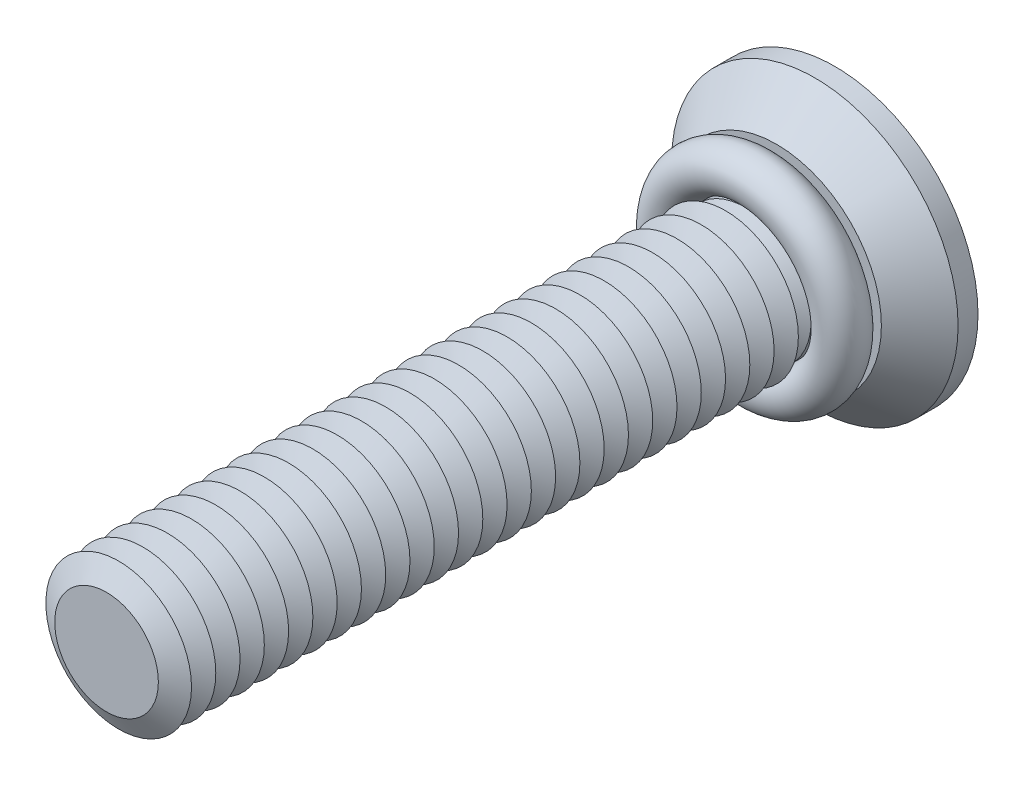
ISO-10303-21;
HEADER;
FILE_DESCRIPTION(('STEP AP214'),'2;1');
FILE_NAME('part.step','',(''),(''),'','','');
FILE_SCHEMA(('AUTOMOTIVE_DESIGN { 1 0 10303 214 1 1 1 1 }'));
ENDSEC;
DATA;
#1=APPLICATION_CONTEXT('core data for automotive mechanical design processes');
#2=APPLICATION_PROTOCOL_DEFINITION('international standard','automotive_design',2000,#1);
#3=PRODUCT_CONTEXT('',#1,'mechanical');
#4=PRODUCT('Part','Part','',(#3));
#5=PRODUCT_RELATED_PRODUCT_CATEGORY('part','',(#4));
#6=PRODUCT_DEFINITION_FORMATION('','',#4);
#7=PRODUCT_DEFINITION_CONTEXT('part definition',#1,'design');
#8=PRODUCT_DEFINITION('design','',#6,#7);
#9=PRODUCT_DEFINITION_SHAPE('','',#8);
#10=(LENGTH_UNIT() NAMED_UNIT(*) SI_UNIT(.MILLI.,.METRE.));
#11=(NAMED_UNIT(*) PLANE_ANGLE_UNIT() SI_UNIT($,.RADIAN.));
#12=(NAMED_UNIT(*) SI_UNIT($,.STERADIAN.) SOLID_ANGLE_UNIT());
#13=UNCERTAINTY_MEASURE_WITH_UNIT(LENGTH_MEASURE(1.E-05),#10,'distance_accuracy_value','');
#14=(GEOMETRIC_REPRESENTATION_CONTEXT(3) GLOBAL_UNCERTAINTY_ASSIGNED_CONTEXT((#13)) GLOBAL_UNIT_ASSIGNED_CONTEXT((#10,
#11,#12)) REPRESENTATION_CONTEXT('',''));
#15=CARTESIAN_POINT('',(0.,0.,0.));
#16=DIRECTION('',(0.,0.,1.));
#17=DIRECTION('',(1.,0.,0.));
#18=AXIS2_PLACEMENT_3D('',#15,#16,#17);
#19=CARTESIAN_POINT('',(0.,0.,3.30000000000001));
#20=DIRECTION('',(0.,0.,1.));
#21=DIRECTION('',(1.,0.,0.));
#22=AXIS2_PLACEMENT_3D('',#19,#20,#21);
#23=TOROIDAL_SURFACE('',#22,3.6,0.9);
#24=CARTESIAN_POINT('',(0.,3.6,3.30000000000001));
#25=DIRECTION('',(1.,0.,0.));
#26=DIRECTION('',(0.,0.,-1.));
#27=AXIS2_PLACEMENT_3D('',#24,#25,#26);
#28=CIRCLE('',#27,0.9);
#29=CARTESIAN_POINT('',(0.,4.5,3.30000000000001));
#30=VERTEX_POINT('',#29);
#31=EDGE_CURVE('P0_E10',#30,#30,#28,.T.);
#32=CARTESIAN_POINT('',(0.,0.,3.30000000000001));
#33=DIRECTION('',(0.,0.,1.));
#34=DIRECTION('',(1.,0.,0.));
#35=AXIS2_PLACEMENT_3D('',#32,#33,#34);
#36=CIRCLE('',#35,4.5);
#37=EDGE_CURVE('',#30,#30,#36,.T.);
#38=ORIENTED_EDGE('',*,*,#31,.F.);
#39=ORIENTED_EDGE('',*,*,#31,.T.);
#40=ORIENTED_EDGE('',*,*,#37,.T.);
#41=ORIENTED_EDGE('',*,*,#37,.F.);
#42=EDGE_LOOP('',(#38,#40,#39,#41));
#43=FACE_BOUND('',#42,.T.);
#44=ADVANCED_FACE('P0_F14',(#43),#23,.T.);
#45=CLOSED_SHELL('',(#44));
#46=MANIFOLD_SOLID_BREP('P0_B1',#45);
#47=CARTESIAN_POINT('',(0.,0.,25.));
#48=DIRECTION('',(0.,0.,-1.));
#49=DIRECTION('',(-1.,0.,0.));
#50=AXIS2_PLACEMENT_3D('',#47,#48,#49);
#51=CONICAL_SURFACE('',#50,2.13397459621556,1.0471975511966);
#52=CARTESIAN_POINT('',(0.,0.,24.5));
#53=DIRECTION('',(0.,0.,1.));
#54=DIRECTION('',(1.,0.,0.));
#55=AXIS2_PLACEMENT_3D('',#52,#53,#54);
#56=CIRCLE('',#55,3.);
#57=CARTESIAN_POINT('',(3.,0.,24.5));
#58=VERTEX_POINT('',#57);
#59=EDGE_CURVE('P1_E324',#58,#58,#56,.T.);
#60=ORIENTED_EDGE('',*,*,#59,.T.);
#61=EDGE_LOOP('',(#60));
#62=FACE_BOUND('',#61,.T.);
#63=CARTESIAN_POINT('',(0.,0.,25.));
#64=DIRECTION('',(0.,0.,1.));
#65=DIRECTION('',(1.,0.,0.));
#66=AXIS2_PLACEMENT_3D('',#63,#64,#65);
#67=CIRCLE('',#66,2.13397459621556);
#68=CARTESIAN_POINT('',(2.13397459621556,0.,25.));
#69=VERTEX_POINT('',#68);
#70=EDGE_CURVE('P1_E321',#69,#69,#67,.T.);
#71=ORIENTED_EDGE('',*,*,#70,.F.);
#72=EDGE_LOOP('',(#71));
#73=FACE_BOUND('',#72,.T.);
#74=ADVANCED_FACE('P1_F15',(#62,#73),#51,.T.);
#75=CARTESIAN_POINT('',(0.,0.,25.5));
#76=DIRECTION('',(0.,0.,1.));
#77=DIRECTION('',(1.,0.,0.));
#78=AXIS2_PLACEMENT_3D('',#75,#76,#77);
#79=CONICAL_SURFACE('',#78,3.,1.0471975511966);
#80=ORIENTED_EDGE('',*,*,#70,.T.);
#81=EDGE_LOOP('',(#80));
#82=FACE_BOUND('',#81,.T.);
#83=CARTESIAN_POINT('',(0.,0.,25.5));
#84=DIRECTION('',(0.,0.,1.));
#85=DIRECTION('',(1.,0.,0.));
#86=AXIS2_PLACEMENT_3D('',#83,#84,#85);
#87=CIRCLE('',#86,3.);
#88=CARTESIAN_POINT('',(3.,0.,25.5));
#89=VERTEX_POINT('',#88);
#90=EDGE_CURVE('P1_E318',#89,#89,#87,.T.);
#91=ORIENTED_EDGE('',*,*,#90,.F.);
#92=EDGE_LOOP('',(#91));
#93=FACE_BOUND('',#92,.T.);
#94=ADVANCED_FACE('P1_F245',(#82,#93),#79,.T.);
#95=CARTESIAN_POINT('',(0.,0.,30.));
#96=DIRECTION('',(0.,0.,1.));
#97=DIRECTION('',(1.,0.,0.));
#98=AXIS2_PLACEMENT_3D('',#95,#96,#97);
#99=PLANE('',#98);
#100=CARTESIAN_POINT('',(0.,0.,30.));
#101=DIRECTION('',(0.,0.,1.));
#102=DIRECTION('',(1.,0.,0.));
#103=AXIS2_PLACEMENT_3D('',#100,#101,#102);
#104=CIRCLE('',#103,2.13397459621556);
#105=CARTESIAN_POINT('',(2.13397459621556,0.,30.));
#106=VERTEX_POINT('',#105);
#107=EDGE_CURVE('P1_E131',#106,#106,#104,.T.);
#108=ORIENTED_EDGE('',*,*,#107,.T.);
#109=EDGE_LOOP('',(#108));
#110=FACE_BOUND('',#109,.T.);
#111=ADVANCED_FACE('P1_F251',(#110),#99,.T.);
#112=CARTESIAN_POINT('',(0.,0.,30.));
#113=DIRECTION('',(0.,0.,-1.));
#114=DIRECTION('',(-1.,0.,0.));
#115=AXIS2_PLACEMENT_3D('',#112,#113,#114);
#116=CONICAL_SURFACE('',#115,2.13397459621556,1.0471975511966);
#117=CARTESIAN_POINT('',(0.,0.,29.5));
#118=DIRECTION('',(0.,0.,1.));
#119=DIRECTION('',(1.,0.,0.));
#120=AXIS2_PLACEMENT_3D('',#117,#118,#119);
#121=CIRCLE('',#120,3.);
#122=CARTESIAN_POINT('',(3.,0.,29.5));
#123=VERTEX_POINT('',#122);
#124=EDGE_CURVE('P1_E133',#123,#123,#121,.T.);
#125=ORIENTED_EDGE('',*,*,#124,.T.);
#126=EDGE_LOOP('',(#125));
#127=FACE_BOUND('',#126,.T.);
#128=ORIENTED_EDGE('',*,*,#107,.F.);
#129=EDGE_LOOP('',(#128));
#130=FACE_BOUND('',#129,.T.);
#131=ADVANCED_FACE('P1_F196',(#127,#130),#116,.T.);
#132=CARTESIAN_POINT('',(0.,0.,29.5));
#133=DIRECTION('',(0.,0.,1.));
#134=DIRECTION('',(1.,0.,0.));
#135=AXIS2_PLACEMENT_3D('',#132,#133,#134);
#136=CONICAL_SURFACE('',#135,3.,1.0471975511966);
#137=CARTESIAN_POINT('',(0.,0.,29.));
#138=DIRECTION('',(0.,0.,1.));
#139=DIRECTION('',(1.,0.,0.));
#140=AXIS2_PLACEMENT_3D('',#137,#138,#139);
#141=CIRCLE('',#140,2.13397459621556);
#142=CARTESIAN_POINT('',(2.13397459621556,0.,29.));
#143=VERTEX_POINT('',#142);
#144=EDGE_CURVE('P1_E297',#143,#143,#141,.T.);
#145=ORIENTED_EDGE('',*,*,#144,.T.);
#146=EDGE_LOOP('',(#145));
#147=FACE_BOUND('',#146,.T.);
#148=ORIENTED_EDGE('',*,*,#124,.F.);
#149=EDGE_LOOP('',(#148));
#150=FACE_BOUND('',#149,.T.);
#151=ADVANCED_FACE('P1_F284',(#147,#150),#136,.T.);
#152=CARTESIAN_POINT('',(0.,0.,29.));
#153=DIRECTION('',(0.,0.,-1.));
#154=DIRECTION('',(-1.,0.,0.));
#155=AXIS2_PLACEMENT_3D('',#152,#153,#154);
#156=CONICAL_SURFACE('',#155,2.13397459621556,1.0471975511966);
#157=CARTESIAN_POINT('',(0.,0.,28.5));
#158=DIRECTION('',(0.,0.,1.));
#159=DIRECTION('',(1.,0.,0.));
#160=AXIS2_PLACEMENT_3D('',#157,#158,#159);
#161=CIRCLE('',#160,3.);
#162=CARTESIAN_POINT('',(3.,0.,28.5));
#163=VERTEX_POINT('',#162);
#164=EDGE_CURVE('P1_E294',#163,#163,#161,.T.);
#165=ORIENTED_EDGE('',*,*,#164,.T.);
#166=EDGE_LOOP('',(#165));
#167=FACE_BOUND('',#166,.T.);
#168=ORIENTED_EDGE('',*,*,#144,.F.);
#169=EDGE_LOOP('',(#168));
#170=FACE_BOUND('',#169,.T.);
#171=ADVANCED_FACE('P1_F279',(#167,#170),#156,.T.);
#172=CARTESIAN_POINT('',(0.,0.,28.5));
#173=DIRECTION('',(0.,0.,1.));
#174=DIRECTION('',(1.,0.,0.));
#175=AXIS2_PLACEMENT_3D('',#172,#173,#174);
#176=CONICAL_SURFACE('',#175,3.,1.0471975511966);
#177=CARTESIAN_POINT('',(0.,0.,28.));
#178=DIRECTION('',(0.,0.,1.));
#179=DIRECTION('',(1.,0.,0.));
#180=AXIS2_PLACEMENT_3D('',#177,#178,#179);
#181=CIRCLE('',#180,2.13397459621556);
#182=CARTESIAN_POINT('',(2.13397459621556,0.,28.));
#183=VERTEX_POINT('',#182);
#184=EDGE_CURVE('P1_E301',#183,#183,#181,.T.);
#185=ORIENTED_EDGE('',*,*,#184,.T.);
#186=EDGE_LOOP('',(#185));
#187=FACE_BOUND('',#186,.T.);
#188=ORIENTED_EDGE('',*,*,#164,.F.);
#189=EDGE_LOOP('',(#188));
#190=FACE_BOUND('',#189,.T.);
#191=ADVANCED_FACE('P1_F276',(#187,#190),#176,.T.);
#192=CARTESIAN_POINT('',(0.,0.,28.));
#193=DIRECTION('',(0.,0.,-1.));
#194=DIRECTION('',(-1.,0.,0.));
#195=AXIS2_PLACEMENT_3D('',#192,#193,#194);
#196=CONICAL_SURFACE('',#195,2.13397459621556,1.0471975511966);
#197=CARTESIAN_POINT('',(0.,0.,27.5));
#198=DIRECTION('',(0.,0.,1.));
#199=DIRECTION('',(1.,0.,0.));
#200=AXIS2_PLACEMENT_3D('',#197,#198,#199);
#201=CIRCLE('',#200,3.);
#202=CARTESIAN_POINT('',(3.,0.,27.5));
#203=VERTEX_POINT('',#202);
#204=EDGE_CURVE('P1_E306',#203,#203,#201,.T.);
#205=ORIENTED_EDGE('',*,*,#204,.T.);
#206=EDGE_LOOP('',(#205));
#207=FACE_BOUND('',#206,.T.);
#208=ORIENTED_EDGE('',*,*,#184,.F.);
#209=EDGE_LOOP('',(#208));
#210=FACE_BOUND('',#209,.T.);
#211=ADVANCED_FACE('P1_F271',(#207,#210),#196,.T.);
#212=CARTESIAN_POINT('',(0.,0.,27.5));
#213=DIRECTION('',(0.,0.,1.));
#214=DIRECTION('',(1.,0.,0.));
#215=AXIS2_PLACEMENT_3D('',#212,#213,#214);
#216=CONICAL_SURFACE('',#215,3.,1.0471975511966);
#217=CARTESIAN_POINT('',(0.,0.,27.));
#218=DIRECTION('',(0.,0.,1.));
#219=DIRECTION('',(1.,0.,0.));
#220=AXIS2_PLACEMENT_3D('',#217,#218,#219);
#221=CIRCLE('',#220,2.13397459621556);
#222=CARTESIAN_POINT('',(2.13397459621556,0.,27.));
#223=VERTEX_POINT('',#222);
#224=EDGE_CURVE('P1_E309',#223,#223,#221,.T.);
#225=ORIENTED_EDGE('',*,*,#224,.T.);
#226=EDGE_LOOP('',(#225));
#227=FACE_BOUND('',#226,.T.);
#228=ORIENTED_EDGE('',*,*,#204,.F.);
#229=EDGE_LOOP('',(#228));
#230=FACE_BOUND('',#229,.T.);
#231=ADVANCED_FACE('P1_F268',(#227,#230),#216,.T.);
#232=CARTESIAN_POINT('',(0.,0.,27.));
#233=DIRECTION('',(0.,0.,-1.));
#234=DIRECTION('',(-1.,0.,0.));
#235=AXIS2_PLACEMENT_3D('',#232,#233,#234);
#236=CONICAL_SURFACE('',#235,2.13397459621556,1.0471975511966);
#237=CARTESIAN_POINT('',(0.,0.,26.5));
#238=DIRECTION('',(0.,0.,1.));
#239=DIRECTION('',(1.,0.,0.));
#240=AXIS2_PLACEMENT_3D('',#237,#238,#239);
#241=CIRCLE('',#240,3.);
#242=CARTESIAN_POINT('',(3.,0.,26.5));
#243=VERTEX_POINT('',#242);
#244=EDGE_CURVE('P1_E312',#243,#243,#241,.T.);
#245=ORIENTED_EDGE('',*,*,#244,.T.);
#246=EDGE_LOOP('',(#245));
#247=FACE_BOUND('',#246,.T.);
#248=ORIENTED_EDGE('',*,*,#224,.F.);
#249=EDGE_LOOP('',(#248));
#250=FACE_BOUND('',#249,.T.);
#251=ADVANCED_FACE('P1_F262',(#247,#250),#236,.T.);
#252=CARTESIAN_POINT('',(0.,0.,26.5));
#253=DIRECTION('',(0.,0.,1.));
#254=DIRECTION('',(1.,0.,0.));
#255=AXIS2_PLACEMENT_3D('',#252,#253,#254);
#256=CONICAL_SURFACE('',#255,3.,1.0471975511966);
#257=CARTESIAN_POINT('',(0.,0.,26.));
#258=DIRECTION('',(0.,0.,1.));
#259=DIRECTION('',(1.,0.,0.));
#260=AXIS2_PLACEMENT_3D('',#257,#258,#259);
#261=CIRCLE('',#260,2.13397459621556);
#262=CARTESIAN_POINT('',(2.13397459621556,0.,26.));
#263=VERTEX_POINT('',#262);
#264=EDGE_CURVE('P1_E315',#263,#263,#261,.T.);
#265=ORIENTED_EDGE('',*,*,#264,.T.);
#266=EDGE_LOOP('',(#265));
#267=FACE_BOUND('',#266,.T.);
#268=ORIENTED_EDGE('',*,*,#244,.F.);
#269=EDGE_LOOP('',(#268));
#270=FACE_BOUND('',#269,.T.);
#271=ADVANCED_FACE('P1_F258',(#267,#270),#256,.T.);
#272=CARTESIAN_POINT('',(0.,0.,26.));
#273=DIRECTION('',(0.,0.,-1.));
#274=DIRECTION('',(-1.,0.,0.));
#275=AXIS2_PLACEMENT_3D('',#272,#273,#274);
#276=CONICAL_SURFACE('',#275,2.13397459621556,1.0471975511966);
#277=ORIENTED_EDGE('',*,*,#90,.T.);
#278=EDGE_LOOP('',(#277));
#279=FACE_BOUND('',#278,.T.);
#280=ORIENTED_EDGE('',*,*,#264,.F.);
#281=EDGE_LOOP('',(#280));
#282=FACE_BOUND('',#281,.T.);
#283=ADVANCED_FACE('P1_F261',(#279,#282),#276,.T.);
#284=CARTESIAN_POINT('',(0.,0.,24.));
#285=DIRECTION('',(0.,0.,-1.));
#286=DIRECTION('',(-1.,0.,0.));
#287=AXIS2_PLACEMENT_3D('',#284,#285,#286);
#288=CONICAL_SURFACE('',#287,2.13397459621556,1.0471975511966);
#289=CARTESIAN_POINT('',(0.,0.,23.5));
#290=DIRECTION('',(0.,0.,1.));
#291=DIRECTION('',(1.,0.,0.));
#292=AXIS2_PLACEMENT_3D('',#289,#290,#291);
#293=CIRCLE('',#292,3.);
#294=CARTESIAN_POINT('',(3.,0.,23.5));
#295=VERTEX_POINT('',#294);
#296=EDGE_CURVE('P1_E329',#295,#295,#293,.T.);
#297=ORIENTED_EDGE('',*,*,#296,.T.);
#298=EDGE_LOOP('',(#297));
#299=FACE_BOUND('',#298,.T.);
#300=CARTESIAN_POINT('',(0.,0.,24.));
#301=DIRECTION('',(0.,0.,1.));
#302=DIRECTION('',(1.,0.,0.));
#303=AXIS2_PLACEMENT_3D('',#300,#301,#302);
#304=CIRCLE('',#303,2.13397459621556);
#305=CARTESIAN_POINT('',(2.13397459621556,0.,24.));
#306=VERTEX_POINT('',#305);
#307=EDGE_CURVE('P1_E326',#306,#306,#304,.T.);
#308=ORIENTED_EDGE('',*,*,#307,.F.);
#309=EDGE_LOOP('',(#308));
#310=FACE_BOUND('',#309,.T.);
#311=ADVANCED_FACE('P1_F266',(#299,#310),#288,.T.);
#312=CARTESIAN_POINT('',(0.,0.,24.5));
#313=DIRECTION('',(0.,0.,1.));
#314=DIRECTION('',(1.,0.,0.));
#315=AXIS2_PLACEMENT_3D('',#312,#313,#314);
#316=CONICAL_SURFACE('',#315,3.,1.0471975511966);
#317=ORIENTED_EDGE('',*,*,#307,.T.);
#318=EDGE_LOOP('',(#317));
#319=FACE_BOUND('',#318,.T.);
#320=ORIENTED_EDGE('',*,*,#59,.F.);
#321=EDGE_LOOP('',(#320));
#322=FACE_BOUND('',#321,.T.);
#323=ADVANCED_FACE('P1_F552',(#319,#322),#316,.T.);
#324=CARTESIAN_POINT('',(0.,0.,23.));
#325=DIRECTION('',(0.,0.,-1.));
#326=DIRECTION('',(-1.,0.,0.));
#327=AXIS2_PLACEMENT_3D('',#324,#325,#326);
#328=CONICAL_SURFACE('',#327,2.13397459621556,1.0471975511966);
#329=CARTESIAN_POINT('',(0.,0.,22.5));
#330=DIRECTION('',(0.,0.,1.));
#331=DIRECTION('',(1.,0.,0.));
#332=AXIS2_PLACEMENT_3D('',#329,#330,#331);
#333=CIRCLE('',#332,3.);
#334=CARTESIAN_POINT('',(3.,0.,22.5));
#335=VERTEX_POINT('',#334);
#336=EDGE_CURVE('P1_E335',#335,#335,#333,.T.);
#337=ORIENTED_EDGE('',*,*,#336,.T.);
#338=EDGE_LOOP('',(#337));
#339=FACE_BOUND('',#338,.T.);
#340=CARTESIAN_POINT('',(0.,0.,23.));
#341=DIRECTION('',(0.,0.,1.));
#342=DIRECTION('',(1.,0.,0.));
#343=AXIS2_PLACEMENT_3D('',#340,#341,#342);
#344=CIRCLE('',#343,2.13397459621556);
#345=CARTESIAN_POINT('',(2.13397459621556,0.,23.));
#346=VERTEX_POINT('',#345);
#347=EDGE_CURVE('P1_E332',#346,#346,#344,.T.);
#348=ORIENTED_EDGE('',*,*,#347,.F.);
#349=EDGE_LOOP('',(#348));
#350=FACE_BOUND('',#349,.T.);
#351=ADVANCED_FACE('P1_F562',(#339,#350),#328,.T.);
#352=CARTESIAN_POINT('',(0.,0.,23.5));
#353=DIRECTION('',(0.,0.,1.));
#354=DIRECTION('',(1.,0.,0.));
#355=AXIS2_PLACEMENT_3D('',#352,#353,#354);
#356=CONICAL_SURFACE('',#355,3.,1.0471975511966);
#357=ORIENTED_EDGE('',*,*,#347,.T.);
#358=EDGE_LOOP('',(#357));
#359=FACE_BOUND('',#358,.T.);
#360=ORIENTED_EDGE('',*,*,#296,.F.);
#361=EDGE_LOOP('',(#360));
#362=FACE_BOUND('',#361,.T.);
#363=ADVANCED_FACE('P1_F572',(#359,#362),#356,.T.);
#364=CARTESIAN_POINT('',(0.,0.,22.));
#365=DIRECTION('',(0.,0.,-1.));
#366=DIRECTION('',(-1.,0.,0.));
#367=AXIS2_PLACEMENT_3D('',#364,#365,#366);
#368=CONICAL_SURFACE('',#367,2.13397459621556,1.0471975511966);
#369=CARTESIAN_POINT('',(0.,0.,21.5));
#370=DIRECTION('',(0.,0.,1.));
#371=DIRECTION('',(1.,0.,0.));
#372=AXIS2_PLACEMENT_3D('',#369,#370,#371);
#373=CIRCLE('',#372,3.);
#374=CARTESIAN_POINT('',(3.,0.,21.5));
#375=VERTEX_POINT('',#374);
#376=EDGE_CURVE('P1_E341',#375,#375,#373,.T.);
#377=ORIENTED_EDGE('',*,*,#376,.T.);
#378=EDGE_LOOP('',(#377));
#379=FACE_BOUND('',#378,.T.);
#380=CARTESIAN_POINT('',(0.,0.,22.));
#381=DIRECTION('',(0.,0.,1.));
#382=DIRECTION('',(1.,0.,0.));
#383=AXIS2_PLACEMENT_3D('',#380,#381,#382);
#384=CIRCLE('',#383,2.13397459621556);
#385=CARTESIAN_POINT('',(2.13397459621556,0.,22.));
#386=VERTEX_POINT('',#385);
#387=EDGE_CURVE('P1_E338',#386,#386,#384,.T.);
#388=ORIENTED_EDGE('',*,*,#387,.F.);
#389=EDGE_LOOP('',(#388));
#390=FACE_BOUND('',#389,.T.);
#391=ADVANCED_FACE('P1_F582',(#379,#390),#368,.T.);
#392=CARTESIAN_POINT('',(0.,0.,22.5));
#393=DIRECTION('',(0.,0.,1.));
#394=DIRECTION('',(1.,0.,0.));
#395=AXIS2_PLACEMENT_3D('',#392,#393,#394);
#396=CONICAL_SURFACE('',#395,3.,1.0471975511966);
#397=ORIENTED_EDGE('',*,*,#387,.T.);
#398=EDGE_LOOP('',(#397));
#399=FACE_BOUND('',#398,.T.);
#400=ORIENTED_EDGE('',*,*,#336,.F.);
#401=EDGE_LOOP('',(#400));
#402=FACE_BOUND('',#401,.T.);
#403=ADVANCED_FACE('P1_F592',(#399,#402),#396,.T.);
#404=CARTESIAN_POINT('',(0.,0.,21.));
#405=DIRECTION('',(0.,0.,-1.));
#406=DIRECTION('',(-1.,0.,0.));
#407=AXIS2_PLACEMENT_3D('',#404,#405,#406);
#408=CONICAL_SURFACE('',#407,2.13397459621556,1.0471975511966);
#409=CARTESIAN_POINT('',(0.,0.,20.5));
#410=DIRECTION('',(0.,0.,1.));
#411=DIRECTION('',(1.,0.,0.));
#412=AXIS2_PLACEMENT_3D('',#409,#410,#411);
#413=CIRCLE('',#412,3.);
#414=CARTESIAN_POINT('',(3.,0.,20.5));
#415=VERTEX_POINT('',#414);
#416=EDGE_CURVE('P1_E347',#415,#415,#413,.T.);
#417=ORIENTED_EDGE('',*,*,#416,.T.);
#418=EDGE_LOOP('',(#417));
#419=FACE_BOUND('',#418,.T.);
#420=CARTESIAN_POINT('',(0.,0.,21.));
#421=DIRECTION('',(0.,0.,1.));
#422=DIRECTION('',(1.,0.,0.));
#423=AXIS2_PLACEMENT_3D('',#420,#421,#422);
#424=CIRCLE('',#423,2.13397459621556);
#425=CARTESIAN_POINT('',(2.13397459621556,0.,21.));
#426=VERTEX_POINT('',#425);
#427=EDGE_CURVE('P1_E344',#426,#426,#424,.T.);
#428=ORIENTED_EDGE('',*,*,#427,.F.);
#429=EDGE_LOOP('',(#428));
#430=FACE_BOUND('',#429,.T.);
#431=ADVANCED_FACE('P1_F602',(#419,#430),#408,.T.);
#432=CARTESIAN_POINT('',(0.,0.,21.5));
#433=DIRECTION('',(0.,0.,1.));
#434=DIRECTION('',(1.,0.,0.));
#435=AXIS2_PLACEMENT_3D('',#432,#433,#434);
#436=CONICAL_SURFACE('',#435,3.,1.0471975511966);
#437=ORIENTED_EDGE('',*,*,#427,.T.);
#438=EDGE_LOOP('',(#437));
#439=FACE_BOUND('',#438,.T.);
#440=ORIENTED_EDGE('',*,*,#376,.F.);
#441=EDGE_LOOP('',(#440));
#442=FACE_BOUND('',#441,.T.);
#443=ADVANCED_FACE('P1_F612',(#439,#442),#436,.T.);
#444=CARTESIAN_POINT('',(0.,0.,20.));
#445=DIRECTION('',(0.,0.,-1.));
#446=DIRECTION('',(-1.,0.,0.));
#447=AXIS2_PLACEMENT_3D('',#444,#445,#446);
#448=CONICAL_SURFACE('',#447,2.13397459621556,1.0471975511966);
#449=CARTESIAN_POINT('',(0.,0.,19.5));
#450=DIRECTION('',(0.,0.,1.));
#451=DIRECTION('',(1.,0.,0.));
#452=AXIS2_PLACEMENT_3D('',#449,#450,#451);
#453=CIRCLE('',#452,3.);
#454=CARTESIAN_POINT('',(3.,0.,19.5));
#455=VERTEX_POINT('',#454);
#456=EDGE_CURVE('P1_E353',#455,#455,#453,.T.);
#457=ORIENTED_EDGE('',*,*,#456,.T.);
#458=EDGE_LOOP('',(#457));
#459=FACE_BOUND('',#458,.T.);
#460=CARTESIAN_POINT('',(0.,0.,20.));
#461=DIRECTION('',(0.,0.,1.));
#462=DIRECTION('',(1.,0.,0.));
#463=AXIS2_PLACEMENT_3D('',#460,#461,#462);
#464=CIRCLE('',#463,2.13397459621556);
#465=CARTESIAN_POINT('',(2.13397459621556,0.,20.));
#466=VERTEX_POINT('',#465);
#467=EDGE_CURVE('P1_E350',#466,#466,#464,.T.);
#468=ORIENTED_EDGE('',*,*,#467,.F.);
#469=EDGE_LOOP('',(#468));
#470=FACE_BOUND('',#469,.T.);
#471=ADVANCED_FACE('P1_F622',(#459,#470),#448,.T.);
#472=CARTESIAN_POINT('',(0.,0.,20.5));
#473=DIRECTION('',(0.,0.,1.));
#474=DIRECTION('',(1.,0.,0.));
#475=AXIS2_PLACEMENT_3D('',#472,#473,#474);
#476=CONICAL_SURFACE('',#475,3.,1.0471975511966);
#477=ORIENTED_EDGE('',*,*,#467,.T.);
#478=EDGE_LOOP('',(#477));
#479=FACE_BOUND('',#478,.T.);
#480=ORIENTED_EDGE('',*,*,#416,.F.);
#481=EDGE_LOOP('',(#480));
#482=FACE_BOUND('',#481,.T.);
#483=ADVANCED_FACE('P1_F632',(#479,#482),#476,.T.);
#484=CARTESIAN_POINT('',(0.,0.,19.));
#485=DIRECTION('',(0.,0.,-1.));
#486=DIRECTION('',(-1.,0.,0.));
#487=AXIS2_PLACEMENT_3D('',#484,#485,#486);
#488=CONICAL_SURFACE('',#487,2.13397459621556,1.0471975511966);
#489=CARTESIAN_POINT('',(0.,0.,18.5));
#490=DIRECTION('',(0.,0.,1.));
#491=DIRECTION('',(1.,0.,0.));
#492=AXIS2_PLACEMENT_3D('',#489,#490,#491);
#493=CIRCLE('',#492,3.);
#494=CARTESIAN_POINT('',(3.,0.,18.5));
#495=VERTEX_POINT('',#494);
#496=EDGE_CURVE('P1_E359',#495,#495,#493,.T.);
#497=ORIENTED_EDGE('',*,*,#496,.T.);
#498=EDGE_LOOP('',(#497));
#499=FACE_BOUND('',#498,.T.);
#500=CARTESIAN_POINT('',(0.,0.,19.));
#501=DIRECTION('',(0.,0.,1.));
#502=DIRECTION('',(1.,0.,0.));
#503=AXIS2_PLACEMENT_3D('',#500,#501,#502);
#504=CIRCLE('',#503,2.13397459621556);
#505=CARTESIAN_POINT('',(2.13397459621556,0.,19.));
#506=VERTEX_POINT('',#505);
#507=EDGE_CURVE('P1_E356',#506,#506,#504,.T.);
#508=ORIENTED_EDGE('',*,*,#507,.F.);
#509=EDGE_LOOP('',(#508));
#510=FACE_BOUND('',#509,.T.);
#511=ADVANCED_FACE('P1_F642',(#499,#510),#488,.T.);
#512=CARTESIAN_POINT('',(0.,0.,19.5));
#513=DIRECTION('',(0.,0.,1.));
#514=DIRECTION('',(1.,0.,0.));
#515=AXIS2_PLACEMENT_3D('',#512,#513,#514);
#516=CONICAL_SURFACE('',#515,3.,1.0471975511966);
#517=ORIENTED_EDGE('',*,*,#507,.T.);
#518=EDGE_LOOP('',(#517));
#519=FACE_BOUND('',#518,.T.);
#520=ORIENTED_EDGE('',*,*,#456,.F.);
#521=EDGE_LOOP('',(#520));
#522=FACE_BOUND('',#521,.T.);
#523=ADVANCED_FACE('P1_F652',(#519,#522),#516,.T.);
#524=CARTESIAN_POINT('',(0.,0.,18.));
#525=DIRECTION('',(0.,0.,-1.));
#526=DIRECTION('',(-1.,0.,0.));
#527=AXIS2_PLACEMENT_3D('',#524,#525,#526);
#528=CONICAL_SURFACE('',#527,2.13397459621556,1.0471975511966);
#529=CARTESIAN_POINT('',(0.,0.,17.5));
#530=DIRECTION('',(0.,0.,1.));
#531=DIRECTION('',(1.,0.,0.));
#532=AXIS2_PLACEMENT_3D('',#529,#530,#531);
#533=CIRCLE('',#532,3.);
#534=CARTESIAN_POINT('',(3.,0.,17.5));
#535=VERTEX_POINT('',#534);
#536=EDGE_CURVE('P1_E365',#535,#535,#533,.T.);
#537=ORIENTED_EDGE('',*,*,#536,.T.);
#538=EDGE_LOOP('',(#537));
#539=FACE_BOUND('',#538,.T.);
#540=CARTESIAN_POINT('',(0.,0.,18.));
#541=DIRECTION('',(0.,0.,1.));
#542=DIRECTION('',(1.,0.,0.));
#543=AXIS2_PLACEMENT_3D('',#540,#541,#542);
#544=CIRCLE('',#543,2.13397459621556);
#545=CARTESIAN_POINT('',(2.13397459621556,0.,18.));
#546=VERTEX_POINT('',#545);
#547=EDGE_CURVE('P1_E362',#546,#546,#544,.T.);
#548=ORIENTED_EDGE('',*,*,#547,.F.);
#549=EDGE_LOOP('',(#548));
#550=FACE_BOUND('',#549,.T.);
#551=ADVANCED_FACE('P1_F662',(#539,#550),#528,.T.);
#552=CARTESIAN_POINT('',(0.,0.,18.5));
#553=DIRECTION('',(0.,0.,1.));
#554=DIRECTION('',(1.,0.,0.));
#555=AXIS2_PLACEMENT_3D('',#552,#553,#554);
#556=CONICAL_SURFACE('',#555,3.,1.0471975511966);
#557=ORIENTED_EDGE('',*,*,#547,.T.);
#558=EDGE_LOOP('',(#557));
#559=FACE_BOUND('',#558,.T.);
#560=ORIENTED_EDGE('',*,*,#496,.F.);
#561=EDGE_LOOP('',(#560));
#562=FACE_BOUND('',#561,.T.);
#563=ADVANCED_FACE('P1_F672',(#559,#562),#556,.T.);
#564=CARTESIAN_POINT('',(0.,0.,17.));
#565=DIRECTION('',(0.,0.,-1.));
#566=DIRECTION('',(-1.,0.,0.));
#567=AXIS2_PLACEMENT_3D('',#564,#565,#566);
#568=CONICAL_SURFACE('',#567,2.13397459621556,1.0471975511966);
#569=CARTESIAN_POINT('',(0.,0.,16.5));
#570=DIRECTION('',(0.,0.,1.));
#571=DIRECTION('',(1.,0.,0.));
#572=AXIS2_PLACEMENT_3D('',#569,#570,#571);
#573=CIRCLE('',#572,3.);
#574=CARTESIAN_POINT('',(3.,0.,16.5));
#575=VERTEX_POINT('',#574);
#576=EDGE_CURVE('P1_E371',#575,#575,#573,.T.);
#577=ORIENTED_EDGE('',*,*,#576,.T.);
#578=EDGE_LOOP('',(#577));
#579=FACE_BOUND('',#578,.T.);
#580=CARTESIAN_POINT('',(0.,0.,17.));
#581=DIRECTION('',(0.,0.,1.));
#582=DIRECTION('',(1.,0.,0.));
#583=AXIS2_PLACEMENT_3D('',#580,#581,#582);
#584=CIRCLE('',#583,2.13397459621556);
#585=CARTESIAN_POINT('',(2.13397459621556,0.,17.));
#586=VERTEX_POINT('',#585);
#587=EDGE_CURVE('P1_E368',#586,#586,#584,.T.);
#588=ORIENTED_EDGE('',*,*,#587,.F.);
#589=EDGE_LOOP('',(#588));
#590=FACE_BOUND('',#589,.T.);
#591=ADVANCED_FACE('P1_F682',(#579,#590),#568,.T.);
#592=CARTESIAN_POINT('',(0.,0.,17.5));
#593=DIRECTION('',(0.,0.,1.));
#594=DIRECTION('',(1.,0.,0.));
#595=AXIS2_PLACEMENT_3D('',#592,#593,#594);
#596=CONICAL_SURFACE('',#595,3.,1.0471975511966);
#597=ORIENTED_EDGE('',*,*,#587,.T.);
#598=EDGE_LOOP('',(#597));
#599=FACE_BOUND('',#598,.T.);
#600=ORIENTED_EDGE('',*,*,#536,.F.);
#601=EDGE_LOOP('',(#600));
#602=FACE_BOUND('',#601,.T.);
#603=ADVANCED_FACE('P1_F692',(#599,#602),#596,.T.);
#604=CARTESIAN_POINT('',(0.,0.,16.));
#605=DIRECTION('',(0.,0.,-1.));
#606=DIRECTION('',(-1.,0.,0.));
#607=AXIS2_PLACEMENT_3D('',#604,#605,#606);
#608=CONICAL_SURFACE('',#607,2.13397459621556,1.0471975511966);
#609=CARTESIAN_POINT('',(0.,0.,15.5));
#610=DIRECTION('',(0.,0.,1.));
#611=DIRECTION('',(1.,0.,0.));
#612=AXIS2_PLACEMENT_3D('',#609,#610,#611);
#613=CIRCLE('',#612,3.);
#614=CARTESIAN_POINT('',(3.,0.,15.5));
#615=VERTEX_POINT('',#614);
#616=EDGE_CURVE('P1_E377',#615,#615,#613,.T.);
#617=ORIENTED_EDGE('',*,*,#616,.T.);
#618=EDGE_LOOP('',(#617));
#619=FACE_BOUND('',#618,.T.);
#620=CARTESIAN_POINT('',(0.,0.,16.));
#621=DIRECTION('',(0.,0.,1.));
#622=DIRECTION('',(1.,0.,0.));
#623=AXIS2_PLACEMENT_3D('',#620,#621,#622);
#624=CIRCLE('',#623,2.13397459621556);
#625=CARTESIAN_POINT('',(2.13397459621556,0.,16.));
#626=VERTEX_POINT('',#625);
#627=EDGE_CURVE('P1_E374',#626,#626,#624,.T.);
#628=ORIENTED_EDGE('',*,*,#627,.F.);
#629=EDGE_LOOP('',(#628));
#630=FACE_BOUND('',#629,.T.);
#631=ADVANCED_FACE('P1_F702',(#619,#630),#608,.T.);
#632=CARTESIAN_POINT('',(0.,0.,16.5));
#633=DIRECTION('',(0.,0.,1.));
#634=DIRECTION('',(1.,0.,0.));
#635=AXIS2_PLACEMENT_3D('',#632,#633,#634);
#636=CONICAL_SURFACE('',#635,3.,1.0471975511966);
#637=ORIENTED_EDGE('',*,*,#627,.T.);
#638=EDGE_LOOP('',(#637));
#639=FACE_BOUND('',#638,.T.);
#640=ORIENTED_EDGE('',*,*,#576,.F.);
#641=EDGE_LOOP('',(#640));
#642=FACE_BOUND('',#641,.T.);
#643=ADVANCED_FACE('P1_F712',(#639,#642),#636,.T.);
#644=CARTESIAN_POINT('',(0.,0.,15.));
#645=DIRECTION('',(0.,0.,-1.));
#646=DIRECTION('',(-1.,0.,0.));
#647=AXIS2_PLACEMENT_3D('',#644,#645,#646);
#648=CONICAL_SURFACE('',#647,2.13397459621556,1.0471975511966);
#649=CARTESIAN_POINT('',(0.,0.,14.5));
#650=DIRECTION('',(0.,0.,1.));
#651=DIRECTION('',(1.,0.,0.));
#652=AXIS2_PLACEMENT_3D('',#649,#650,#651);
#653=CIRCLE('',#652,3.);
#654=CARTESIAN_POINT('',(3.,0.,14.5));
#655=VERTEX_POINT('',#654);
#656=EDGE_CURVE('P1_E383',#655,#655,#653,.T.);
#657=ORIENTED_EDGE('',*,*,#656,.T.);
#658=EDGE_LOOP('',(#657));
#659=FACE_BOUND('',#658,.T.);
#660=CARTESIAN_POINT('',(0.,0.,15.));
#661=DIRECTION('',(0.,0.,1.));
#662=DIRECTION('',(1.,0.,0.));
#663=AXIS2_PLACEMENT_3D('',#660,#661,#662);
#664=CIRCLE('',#663,2.13397459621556);
#665=CARTESIAN_POINT('',(2.13397459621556,0.,15.));
#666=VERTEX_POINT('',#665);
#667=EDGE_CURVE('P1_E380',#666,#666,#664,.T.);
#668=ORIENTED_EDGE('',*,*,#667,.F.);
#669=EDGE_LOOP('',(#668));
#670=FACE_BOUND('',#669,.T.);
#671=ADVANCED_FACE('P1_F722',(#659,#670),#648,.T.);
#672=CARTESIAN_POINT('',(0.,0.,15.5));
#673=DIRECTION('',(0.,0.,1.));
#674=DIRECTION('',(1.,0.,0.));
#675=AXIS2_PLACEMENT_3D('',#672,#673,#674);
#676=CONICAL_SURFACE('',#675,3.,1.0471975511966);
#677=ORIENTED_EDGE('',*,*,#667,.T.);
#678=EDGE_LOOP('',(#677));
#679=FACE_BOUND('',#678,.T.);
#680=ORIENTED_EDGE('',*,*,#616,.F.);
#681=EDGE_LOOP('',(#680));
#682=FACE_BOUND('',#681,.T.);
#683=ADVANCED_FACE('P1_F732',(#679,#682),#676,.T.);
#684=CARTESIAN_POINT('',(0.,0.,14.));
#685=DIRECTION('',(0.,0.,-1.));
#686=DIRECTION('',(-1.,0.,0.));
#687=AXIS2_PLACEMENT_3D('',#684,#685,#686);
#688=CONICAL_SURFACE('',#687,2.13397459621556,1.0471975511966);
#689=CARTESIAN_POINT('',(0.,0.,13.5));
#690=DIRECTION('',(0.,0.,1.));
#691=DIRECTION('',(1.,0.,0.));
#692=AXIS2_PLACEMENT_3D('',#689,#690,#691);
#693=CIRCLE('',#692,3.);
#694=CARTESIAN_POINT('',(3.,0.,13.5));
#695=VERTEX_POINT('',#694);
#696=EDGE_CURVE('P1_E389',#695,#695,#693,.T.);
#697=ORIENTED_EDGE('',*,*,#696,.T.);
#698=EDGE_LOOP('',(#697));
#699=FACE_BOUND('',#698,.T.);
#700=CARTESIAN_POINT('',(0.,0.,14.));
#701=DIRECTION('',(0.,0.,1.));
#702=DIRECTION('',(1.,0.,0.));
#703=AXIS2_PLACEMENT_3D('',#700,#701,#702);
#704=CIRCLE('',#703,2.13397459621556);
#705=CARTESIAN_POINT('',(2.13397459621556,0.,14.));
#706=VERTEX_POINT('',#705);
#707=EDGE_CURVE('P1_E386',#706,#706,#704,.T.);
#708=ORIENTED_EDGE('',*,*,#707,.F.);
#709=EDGE_LOOP('',(#708));
#710=FACE_BOUND('',#709,.T.);
#711=ADVANCED_FACE('P1_F742',(#699,#710),#688,.T.);
#712=CARTESIAN_POINT('',(0.,0.,14.5));
#713=DIRECTION('',(0.,0.,1.));
#714=DIRECTION('',(1.,0.,0.));
#715=AXIS2_PLACEMENT_3D('',#712,#713,#714);
#716=CONICAL_SURFACE('',#715,3.,1.0471975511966);
#717=ORIENTED_EDGE('',*,*,#707,.T.);
#718=EDGE_LOOP('',(#717));
#719=FACE_BOUND('',#718,.T.);
#720=ORIENTED_EDGE('',*,*,#656,.F.);
#721=EDGE_LOOP('',(#720));
#722=FACE_BOUND('',#721,.T.);
#723=ADVANCED_FACE('P1_F752',(#719,#722),#716,.T.);
#724=CARTESIAN_POINT('',(0.,0.,13.));
#725=DIRECTION('',(0.,0.,-1.));
#726=DIRECTION('',(-1.,0.,0.));
#727=AXIS2_PLACEMENT_3D('',#724,#725,#726);
#728=CONICAL_SURFACE('',#727,2.13397459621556,1.0471975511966);
#729=CARTESIAN_POINT('',(0.,0.,12.5));
#730=DIRECTION('',(0.,0.,1.));
#731=DIRECTION('',(1.,0.,0.));
#732=AXIS2_PLACEMENT_3D('',#729,#730,#731);
#733=CIRCLE('',#732,3.);
#734=CARTESIAN_POINT('',(3.,0.,12.5));
#735=VERTEX_POINT('',#734);
#736=EDGE_CURVE('P1_E395',#735,#735,#733,.T.);
#737=ORIENTED_EDGE('',*,*,#736,.T.);
#738=EDGE_LOOP('',(#737));
#739=FACE_BOUND('',#738,.T.);
#740=CARTESIAN_POINT('',(0.,0.,13.));
#741=DIRECTION('',(0.,0.,1.));
#742=DIRECTION('',(1.,0.,0.));
#743=AXIS2_PLACEMENT_3D('',#740,#741,#742);
#744=CIRCLE('',#743,2.13397459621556);
#745=CARTESIAN_POINT('',(2.13397459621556,0.,13.));
#746=VERTEX_POINT('',#745);
#747=EDGE_CURVE('P1_E392',#746,#746,#744,.T.);
#748=ORIENTED_EDGE('',*,*,#747,.F.);
#749=EDGE_LOOP('',(#748));
#750=FACE_BOUND('',#749,.T.);
#751=ADVANCED_FACE('P1_F762',(#739,#750),#728,.T.);
#752=CARTESIAN_POINT('',(0.,0.,13.5));
#753=DIRECTION('',(0.,0.,1.));
#754=DIRECTION('',(1.,0.,0.));
#755=AXIS2_PLACEMENT_3D('',#752,#753,#754);
#756=CONICAL_SURFACE('',#755,3.,1.0471975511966);
#757=ORIENTED_EDGE('',*,*,#747,.T.);
#758=EDGE_LOOP('',(#757));
#759=FACE_BOUND('',#758,.T.);
#760=ORIENTED_EDGE('',*,*,#696,.F.);
#761=EDGE_LOOP('',(#760));
#762=FACE_BOUND('',#761,.T.);
#763=ADVANCED_FACE('P1_F772',(#759,#762),#756,.T.);
#764=CARTESIAN_POINT('',(0.,0.,12.));
#765=DIRECTION('',(0.,0.,-1.));
#766=DIRECTION('',(-1.,0.,0.));
#767=AXIS2_PLACEMENT_3D('',#764,#765,#766);
#768=CONICAL_SURFACE('',#767,2.13397459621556,1.0471975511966);
#769=CARTESIAN_POINT('',(0.,0.,11.5));
#770=DIRECTION('',(0.,0.,1.));
#771=DIRECTION('',(1.,0.,0.));
#772=AXIS2_PLACEMENT_3D('',#769,#770,#771);
#773=CIRCLE('',#772,3.);
#774=CARTESIAN_POINT('',(3.,0.,11.5));
#775=VERTEX_POINT('',#774);
#776=EDGE_CURVE('P1_E401',#775,#775,#773,.T.);
#777=ORIENTED_EDGE('',*,*,#776,.T.);
#778=EDGE_LOOP('',(#777));
#779=FACE_BOUND('',#778,.T.);
#780=CARTESIAN_POINT('',(0.,0.,12.));
#781=DIRECTION('',(0.,0.,1.));
#782=DIRECTION('',(1.,0.,0.));
#783=AXIS2_PLACEMENT_3D('',#780,#781,#782);
#784=CIRCLE('',#783,2.13397459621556);
#785=CARTESIAN_POINT('',(2.13397459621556,0.,12.));
#786=VERTEX_POINT('',#785);
#787=EDGE_CURVE('P1_E398',#786,#786,#784,.T.);
#788=ORIENTED_EDGE('',*,*,#787,.F.);
#789=EDGE_LOOP('',(#788));
#790=FACE_BOUND('',#789,.T.);
#791=ADVANCED_FACE('P1_F782',(#779,#790),#768,.T.);
#792=CARTESIAN_POINT('',(0.,0.,12.5));
#793=DIRECTION('',(0.,0.,1.));
#794=DIRECTION('',(1.,0.,0.));
#795=AXIS2_PLACEMENT_3D('',#792,#793,#794);
#796=CONICAL_SURFACE('',#795,3.,1.0471975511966);
#797=ORIENTED_EDGE('',*,*,#787,.T.);
#798=EDGE_LOOP('',(#797));
#799=FACE_BOUND('',#798,.T.);
#800=ORIENTED_EDGE('',*,*,#736,.F.);
#801=EDGE_LOOP('',(#800));
#802=FACE_BOUND('',#801,.T.);
#803=ADVANCED_FACE('P1_F792',(#799,#802),#796,.T.);
#804=CARTESIAN_POINT('',(0.,0.,11.));
#805=DIRECTION('',(0.,0.,-1.));
#806=DIRECTION('',(-1.,0.,0.));
#807=AXIS2_PLACEMENT_3D('',#804,#805,#806);
#808=CONICAL_SURFACE('',#807,2.13397459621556,1.0471975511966);
#809=CARTESIAN_POINT('',(0.,0.,10.5));
#810=DIRECTION('',(0.,0.,1.));
#811=DIRECTION('',(1.,0.,0.));
#812=AXIS2_PLACEMENT_3D('',#809,#810,#811);
#813=CIRCLE('',#812,3.);
#814=CARTESIAN_POINT('',(3.,0.,10.5));
#815=VERTEX_POINT('',#814);
#816=EDGE_CURVE('P1_E407',#815,#815,#813,.T.);
#817=ORIENTED_EDGE('',*,*,#816,.T.);
#818=EDGE_LOOP('',(#817));
#819=FACE_BOUND('',#818,.T.);
#820=CARTESIAN_POINT('',(0.,0.,11.));
#821=DIRECTION('',(0.,0.,1.));
#822=DIRECTION('',(1.,0.,0.));
#823=AXIS2_PLACEMENT_3D('',#820,#821,#822);
#824=CIRCLE('',#823,2.13397459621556);
#825=CARTESIAN_POINT('',(2.13397459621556,0.,11.));
#826=VERTEX_POINT('',#825);
#827=EDGE_CURVE('P1_E404',#826,#826,#824,.T.);
#828=ORIENTED_EDGE('',*,*,#827,.F.);
#829=EDGE_LOOP('',(#828));
#830=FACE_BOUND('',#829,.T.);
#831=ADVANCED_FACE('P1_F802',(#819,#830),#808,.T.);
#832=CARTESIAN_POINT('',(0.,0.,11.5));
#833=DIRECTION('',(0.,0.,1.));
#834=DIRECTION('',(1.,0.,0.));
#835=AXIS2_PLACEMENT_3D('',#832,#833,#834);
#836=CONICAL_SURFACE('',#835,3.,1.0471975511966);
#837=ORIENTED_EDGE('',*,*,#827,.T.);
#838=EDGE_LOOP('',(#837));
#839=FACE_BOUND('',#838,.T.);
#840=ORIENTED_EDGE('',*,*,#776,.F.);
#841=EDGE_LOOP('',(#840));
#842=FACE_BOUND('',#841,.T.);
#843=ADVANCED_FACE('P1_F812',(#839,#842),#836,.T.);
#844=CARTESIAN_POINT('',(0.,0.,10.));
#845=DIRECTION('',(0.,0.,-1.));
#846=DIRECTION('',(-1.,0.,0.));
#847=AXIS2_PLACEMENT_3D('',#844,#845,#846);
#848=CONICAL_SURFACE('',#847,2.13397459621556,1.0471975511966);
#849=CARTESIAN_POINT('',(0.,0.,9.5));
#850=DIRECTION('',(0.,0.,1.));
#851=DIRECTION('',(1.,0.,0.));
#852=AXIS2_PLACEMENT_3D('',#849,#850,#851);
#853=CIRCLE('',#852,3.);
#854=CARTESIAN_POINT('',(3.,0.,9.5));
#855=VERTEX_POINT('',#854);
#856=EDGE_CURVE('P1_E413',#855,#855,#853,.T.);
#857=ORIENTED_EDGE('',*,*,#856,.T.);
#858=EDGE_LOOP('',(#857));
#859=FACE_BOUND('',#858,.T.);
#860=CARTESIAN_POINT('',(0.,0.,10.));
#861=DIRECTION('',(0.,0.,1.));
#862=DIRECTION('',(1.,0.,0.));
#863=AXIS2_PLACEMENT_3D('',#860,#861,#862);
#864=CIRCLE('',#863,2.13397459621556);
#865=CARTESIAN_POINT('',(2.13397459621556,0.,10.));
#866=VERTEX_POINT('',#865);
#867=EDGE_CURVE('P1_E410',#866,#866,#864,.T.);
#868=ORIENTED_EDGE('',*,*,#867,.F.);
#869=EDGE_LOOP('',(#868));
#870=FACE_BOUND('',#869,.T.);
#871=ADVANCED_FACE('P1_F822',(#859,#870),#848,.T.);
#872=CARTESIAN_POINT('',(0.,0.,10.5));
#873=DIRECTION('',(0.,0.,1.));
#874=DIRECTION('',(1.,0.,0.));
#875=AXIS2_PLACEMENT_3D('',#872,#873,#874);
#876=CONICAL_SURFACE('',#875,3.,1.0471975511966);
#877=ORIENTED_EDGE('',*,*,#867,.T.);
#878=EDGE_LOOP('',(#877));
#879=FACE_BOUND('',#878,.T.);
#880=ORIENTED_EDGE('',*,*,#816,.F.);
#881=EDGE_LOOP('',(#880));
#882=FACE_BOUND('',#881,.T.);
#883=ADVANCED_FACE('P1_F832',(#879,#882),#876,.T.);
#884=CARTESIAN_POINT('',(0.,0.,9.));
#885=DIRECTION('',(0.,0.,-1.));
#886=DIRECTION('',(-1.,0.,0.));
#887=AXIS2_PLACEMENT_3D('',#884,#885,#886);
#888=CONICAL_SURFACE('',#887,2.13397459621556,1.0471975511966);
#889=CARTESIAN_POINT('',(0.,0.,8.5));
#890=DIRECTION('',(0.,0.,1.));
#891=DIRECTION('',(1.,0.,0.));
#892=AXIS2_PLACEMENT_3D('',#889,#890,#891);
#893=CIRCLE('',#892,3.);
#894=CARTESIAN_POINT('',(3.,0.,8.5));
#895=VERTEX_POINT('',#894);
#896=EDGE_CURVE('P1_E419',#895,#895,#893,.T.);
#897=ORIENTED_EDGE('',*,*,#896,.T.);
#898=EDGE_LOOP('',(#897));
#899=FACE_BOUND('',#898,.T.);
#900=CARTESIAN_POINT('',(0.,0.,9.));
#901=DIRECTION('',(0.,0.,1.));
#902=DIRECTION('',(1.,0.,0.));
#903=AXIS2_PLACEMENT_3D('',#900,#901,#902);
#904=CIRCLE('',#903,2.13397459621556);
#905=CARTESIAN_POINT('',(2.13397459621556,0.,9.));
#906=VERTEX_POINT('',#905);
#907=EDGE_CURVE('P1_E416',#906,#906,#904,.T.);
#908=ORIENTED_EDGE('',*,*,#907,.F.);
#909=EDGE_LOOP('',(#908));
#910=FACE_BOUND('',#909,.T.);
#911=ADVANCED_FACE('P1_F842',(#899,#910),#888,.T.);
#912=CARTESIAN_POINT('',(0.,0.,9.5));
#913=DIRECTION('',(0.,0.,1.));
#914=DIRECTION('',(1.,0.,0.));
#915=AXIS2_PLACEMENT_3D('',#912,#913,#914);
#916=CONICAL_SURFACE('',#915,3.,1.0471975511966);
#917=ORIENTED_EDGE('',*,*,#907,.T.);
#918=EDGE_LOOP('',(#917));
#919=FACE_BOUND('',#918,.T.);
#920=ORIENTED_EDGE('',*,*,#856,.F.);
#921=EDGE_LOOP('',(#920));
#922=FACE_BOUND('',#921,.T.);
#923=ADVANCED_FACE('P1_F852',(#919,#922),#916,.T.);
#924=CARTESIAN_POINT('',(0.,0.,8.));
#925=DIRECTION('',(0.,0.,-1.));
#926=DIRECTION('',(-1.,0.,0.));
#927=AXIS2_PLACEMENT_3D('',#924,#925,#926);
#928=CONICAL_SURFACE('',#927,2.13397459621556,1.0471975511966);
#929=CARTESIAN_POINT('',(0.,0.,7.5));
#930=DIRECTION('',(0.,0.,1.));
#931=DIRECTION('',(1.,0.,0.));
#932=AXIS2_PLACEMENT_3D('',#929,#930,#931);
#933=CIRCLE('',#932,3.);
#934=CARTESIAN_POINT('',(3.,0.,7.5));
#935=VERTEX_POINT('',#934);
#936=EDGE_CURVE('P1_E425',#935,#935,#933,.T.);
#937=ORIENTED_EDGE('',*,*,#936,.T.);
#938=EDGE_LOOP('',(#937));
#939=FACE_BOUND('',#938,.T.);
#940=CARTESIAN_POINT('',(0.,0.,8.));
#941=DIRECTION('',(0.,0.,1.));
#942=DIRECTION('',(1.,0.,0.));
#943=AXIS2_PLACEMENT_3D('',#940,#941,#942);
#944=CIRCLE('',#943,2.13397459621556);
#945=CARTESIAN_POINT('',(2.13397459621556,0.,8.));
#946=VERTEX_POINT('',#945);
#947=EDGE_CURVE('P1_E422',#946,#946,#944,.T.);
#948=ORIENTED_EDGE('',*,*,#947,.F.);
#949=EDGE_LOOP('',(#948));
#950=FACE_BOUND('',#949,.T.);
#951=ADVANCED_FACE('P1_F862',(#939,#950),#928,.T.);
#952=CARTESIAN_POINT('',(0.,0.,8.5));
#953=DIRECTION('',(0.,0.,1.));
#954=DIRECTION('',(1.,0.,0.));
#955=AXIS2_PLACEMENT_3D('',#952,#953,#954);
#956=CONICAL_SURFACE('',#955,3.,1.0471975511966);
#957=ORIENTED_EDGE('',*,*,#947,.T.);
#958=EDGE_LOOP('',(#957));
#959=FACE_BOUND('',#958,.T.);
#960=ORIENTED_EDGE('',*,*,#896,.F.);
#961=EDGE_LOOP('',(#960));
#962=FACE_BOUND('',#961,.T.);
#963=ADVANCED_FACE('P1_F872',(#959,#962),#956,.T.);
#964=CARTESIAN_POINT('',(0.,0.,7.));
#965=DIRECTION('',(0.,0.,-1.));
#966=DIRECTION('',(-1.,0.,0.));
#967=AXIS2_PLACEMENT_3D('',#964,#965,#966);
#968=CONICAL_SURFACE('',#967,2.13397459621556,1.0471975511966);
#969=CARTESIAN_POINT('',(0.,0.,6.5));
#970=DIRECTION('',(0.,0.,1.));
#971=DIRECTION('',(1.,0.,0.));
#972=AXIS2_PLACEMENT_3D('',#969,#970,#971);
#973=CIRCLE('',#972,3.);
#974=CARTESIAN_POINT('',(3.,0.,6.5));
#975=VERTEX_POINT('',#974);
#976=EDGE_CURVE('P1_E431',#975,#975,#973,.T.);
#977=ORIENTED_EDGE('',*,*,#976,.T.);
#978=EDGE_LOOP('',(#977));
#979=FACE_BOUND('',#978,.T.);
#980=CARTESIAN_POINT('',(0.,0.,7.));
#981=DIRECTION('',(0.,0.,1.));
#982=DIRECTION('',(1.,0.,0.));
#983=AXIS2_PLACEMENT_3D('',#980,#981,#982);
#984=CIRCLE('',#983,2.13397459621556);
#985=CARTESIAN_POINT('',(2.13397459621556,0.,7.));
#986=VERTEX_POINT('',#985);
#987=EDGE_CURVE('P1_E428',#986,#986,#984,.T.);
#988=ORIENTED_EDGE('',*,*,#987,.F.);
#989=EDGE_LOOP('',(#988));
#990=FACE_BOUND('',#989,.T.);
#991=ADVANCED_FACE('P1_F882',(#979,#990),#968,.T.);
#992=CARTESIAN_POINT('',(0.,0.,7.5));
#993=DIRECTION('',(0.,0.,1.));
#994=DIRECTION('',(1.,0.,0.));
#995=AXIS2_PLACEMENT_3D('',#992,#993,#994);
#996=CONICAL_SURFACE('',#995,3.,1.0471975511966);
#997=ORIENTED_EDGE('',*,*,#987,.T.);
#998=EDGE_LOOP('',(#997));
#999=FACE_BOUND('',#998,.T.);
#1000=ORIENTED_EDGE('',*,*,#936,.F.);
#1001=EDGE_LOOP('',(#1000));
#1002=FACE_BOUND('',#1001,.T.);
#1003=ADVANCED_FACE('P1_F892',(#999,#1002),#996,.T.);
#1004=CARTESIAN_POINT('',(0.,0.,6.));
#1005=DIRECTION('',(0.,0.,-1.));
#1006=DIRECTION('',(-1.,0.,0.));
#1007=AXIS2_PLACEMENT_3D('',#1004,#1005,#1006);
#1008=CONICAL_SURFACE('',#1007,2.13397459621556,1.0471975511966);
#1009=CARTESIAN_POINT('',(0.,0.,5.5));
#1010=DIRECTION('',(0.,0.,1.));
#1011=DIRECTION('',(1.,0.,0.));
#1012=AXIS2_PLACEMENT_3D('',#1009,#1010,#1011);
#1013=CIRCLE('',#1012,3.);
#1014=CARTESIAN_POINT('',(3.,0.,5.5));
#1015=VERTEX_POINT('',#1014);
#1016=EDGE_CURVE('P1_E437',#1015,#1015,#1013,.T.);
#1017=ORIENTED_EDGE('',*,*,#1016,.T.);
#1018=EDGE_LOOP('',(#1017));
#1019=FACE_BOUND('',#1018,.T.);
#1020=CARTESIAN_POINT('',(0.,0.,6.));
#1021=DIRECTION('',(0.,0.,1.));
#1022=DIRECTION('',(1.,0.,0.));
#1023=AXIS2_PLACEMENT_3D('',#1020,#1021,#1022);
#1024=CIRCLE('',#1023,2.13397459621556);
#1025=CARTESIAN_POINT('',(2.13397459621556,0.,6.));
#1026=VERTEX_POINT('',#1025);
#1027=EDGE_CURVE('P1_E434',#1026,#1026,#1024,.T.);
#1028=ORIENTED_EDGE('',*,*,#1027,.F.);
#1029=EDGE_LOOP('',(#1028));
#1030=FACE_BOUND('',#1029,.T.);
#1031=ADVANCED_FACE('P1_F902',(#1019,#1030),#1008,.T.);
#1032=CARTESIAN_POINT('',(0.,0.,6.5));
#1033=DIRECTION('',(0.,0.,1.));
#1034=DIRECTION('',(1.,0.,0.));
#1035=AXIS2_PLACEMENT_3D('',#1032,#1033,#1034);
#1036=CONICAL_SURFACE('',#1035,3.,1.0471975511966);
#1037=ORIENTED_EDGE('',*,*,#1027,.T.);
#1038=EDGE_LOOP('',(#1037));
#1039=FACE_BOUND('',#1038,.T.);
#1040=ORIENTED_EDGE('',*,*,#976,.F.);
#1041=EDGE_LOOP('',(#1040));
#1042=FACE_BOUND('',#1041,.T.);
#1043=ADVANCED_FACE('P1_F912',(#1039,#1042),#1036,.T.);
#1044=CARTESIAN_POINT('',(0.,0.,5.));
#1045=DIRECTION('',(0.,0.,-1.));
#1046=DIRECTION('',(-1.,0.,0.));
#1047=AXIS2_PLACEMENT_3D('',#1044,#1045,#1046);
#1048=CONICAL_SURFACE('',#1047,2.13397459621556,1.0471975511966);
#1049=CARTESIAN_POINT('',(0.,0.,4.5));
#1050=DIRECTION('',(0.,0.,1.));
#1051=DIRECTION('',(1.,0.,0.));
#1052=AXIS2_PLACEMENT_3D('',#1049,#1050,#1051);
#1053=CIRCLE('',#1052,3.);
#1054=CARTESIAN_POINT('',(3.,0.,4.5));
#1055=VERTEX_POINT('',#1054);
#1056=EDGE_CURVE('P1_E443',#1055,#1055,#1053,.T.);
#1057=ORIENTED_EDGE('',*,*,#1056,.T.);
#1058=EDGE_LOOP('',(#1057));
#1059=FACE_BOUND('',#1058,.T.);
#1060=CARTESIAN_POINT('',(0.,0.,5.));
#1061=DIRECTION('',(0.,0.,1.));
#1062=DIRECTION('',(1.,0.,0.));
#1063=AXIS2_PLACEMENT_3D('',#1060,#1061,#1062);
#1064=CIRCLE('',#1063,2.13397459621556);
#1065=CARTESIAN_POINT('',(2.13397459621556,0.,5.));
#1066=VERTEX_POINT('',#1065);
#1067=EDGE_CURVE('P1_E440',#1066,#1066,#1064,.T.);
#1068=ORIENTED_EDGE('',*,*,#1067,.F.);
#1069=EDGE_LOOP('',(#1068));
#1070=FACE_BOUND('',#1069,.T.);
#1071=ADVANCED_FACE('P1_F922',(#1059,#1070),#1048,.T.);
#1072=CARTESIAN_POINT('',(0.,0.,5.5));
#1073=DIRECTION('',(0.,0.,1.));
#1074=DIRECTION('',(1.,0.,0.));
#1075=AXIS2_PLACEMENT_3D('',#1072,#1073,#1074);
#1076=CONICAL_SURFACE('',#1075,3.,1.0471975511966);
#1077=ORIENTED_EDGE('',*,*,#1067,.T.);
#1078=EDGE_LOOP('',(#1077));
#1079=FACE_BOUND('',#1078,.T.);
#1080=ORIENTED_EDGE('',*,*,#1016,.F.);
#1081=EDGE_LOOP('',(#1080));
#1082=FACE_BOUND('',#1081,.T.);
#1083=ADVANCED_FACE('P1_F456',(#1079,#1082),#1076,.T.);
#1084=CARTESIAN_POINT('',(0.,0.,4.));
#1085=DIRECTION('',(0.,0.,-1.));
#1086=DIRECTION('',(-1.,0.,0.));
#1087=AXIS2_PLACEMENT_3D('',#1084,#1085,#1086);
#1088=CONICAL_SURFACE('',#1087,2.13397459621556,1.0471975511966);
#1089=CARTESIAN_POINT('',(0.,0.,4.));
#1090=DIRECTION('',(0.,0.,1.));
#1091=DIRECTION('',(1.,0.,0.));
#1092=AXIS2_PLACEMENT_3D('',#1089,#1090,#1091);
#1093=CIRCLE('',#1092,2.13397459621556);
#1094=CARTESIAN_POINT('',(2.13397459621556,0.,4.));
#1095=VERTEX_POINT('',#1094);
#1096=EDGE_CURVE('P1_E446',#1095,#1095,#1093,.T.);
#1097=ORIENTED_EDGE('',*,*,#1096,.F.);
#1098=EDGE_LOOP('',(#1097));
#1099=FACE_BOUND('',#1098,.T.);
#1100=CARTESIAN_POINT('',(0.,0.,3.67320508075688));
#1101=DIRECTION('',(0.,0.,-1.));
#1102=DIRECTION('',(-1.,0.,0.));
#1103=AXIS2_PLACEMENT_3D('',#1100,#1101,#1102);
#1104=CIRCLE('',#1103,2.7);
#1105=CARTESIAN_POINT('',(-2.7,0.,3.67320508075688));
#1106=VERTEX_POINT('',#1105);
#1107=EDGE_CURVE('P1_E19',#1106,#1106,#1104,.F.);
#1108=ORIENTED_EDGE('',*,*,#1107,.T.);
#1109=EDGE_LOOP('',(#1108));
#1110=FACE_BOUND('',#1109,.T.);
#1111=ADVANCED_FACE('P1_F453',(#1099,#1110),#1088,.T.);
#1112=CARTESIAN_POINT('',(0.,0.,4.5));
#1113=DIRECTION('',(0.,0.,1.));
#1114=DIRECTION('',(1.,0.,0.));
#1115=AXIS2_PLACEMENT_3D('',#1112,#1113,#1114);
#1116=CONICAL_SURFACE('',#1115,3.,1.0471975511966);
#1117=ORIENTED_EDGE('',*,*,#1096,.T.);
#1118=EDGE_LOOP('',(#1117));
#1119=FACE_BOUND('',#1118,.T.);
#1120=ORIENTED_EDGE('',*,*,#1056,.F.);
#1121=EDGE_LOOP('',(#1120));
#1122=FACE_BOUND('',#1121,.T.);
#1123=ADVANCED_FACE('P1_F450',(#1119,#1122),#1116,.T.);
#1124=CARTESIAN_POINT('',(0.,0.,2.5));
#1125=DIRECTION('',(0.,0.,-1.));
#1126=DIRECTION('',(-1.,0.,0.));
#1127=AXIS2_PLACEMENT_3D('',#1124,#1125,#1126);
#1128=CONICAL_SURFACE('',#1127,2.,1.0471975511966);
#1129=CARTESIAN_POINT('',(0.,0.,3.65470053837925));
#1130=VERTEX_POINT('',#1129);
#1131=VERTEX_LOOP('',#1130);
#1132=FACE_BOUND('',#1131,.T.);
#1133=CARTESIAN_POINT('',(0.,0.,2.5));
#1134=DIRECTION('',(0.,0.,-1.));
#1135=DIRECTION('',(-1.,0.,0.));
#1136=AXIS2_PLACEMENT_3D('',#1133,#1134,#1135);
#1137=CIRCLE('',#1136,2.);
#1138=CARTESIAN_POINT('',(-2.,0.,2.5));
#1139=VERTEX_POINT('',#1138);
#1140=CARTESIAN_POINT('',(-1.,1.73205080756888,2.5));
#1141=VERTEX_POINT('',#1140);
#1142=EDGE_CURVE('P1_E117',#1139,#1141,#1137,.T.);
#1143=ORIENTED_EDGE('',*,*,#1142,.T.);
#1144=CARTESIAN_POINT('',(0.,0.,2.5));
#1145=DIRECTION('',(0.,0.,-1.));
#1146=DIRECTION('',(-1.,0.,0.));
#1147=AXIS2_PLACEMENT_3D('',#1144,#1145,#1146);
#1148=CIRCLE('',#1147,2.);
#1149=CARTESIAN_POINT('',(1.,1.73205080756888,2.5));
#1150=VERTEX_POINT('',#1149);
#1151=EDGE_CURVE('P1_E24',#1141,#1150,#1148,.T.);
#1152=ORIENTED_EDGE('',*,*,#1151,.T.);
#1153=CARTESIAN_POINT('',(2.,0.,2.5));
#1154=VERTEX_POINT('',#1153);
#1155=EDGE_CURVE('P1_E1155',#1150,#1154,#1148,.T.);
#1156=ORIENTED_EDGE('',*,*,#1155,.T.);
#1157=CARTESIAN_POINT('',(1.,-1.73205080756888,2.5));
#1158=VERTEX_POINT('',#1157);
#1159=EDGE_CURVE('P1_E1148',#1154,#1158,#1148,.T.);
#1160=ORIENTED_EDGE('',*,*,#1159,.T.);
#1161=CARTESIAN_POINT('',(-1.,-1.73205080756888,2.5));
#1162=VERTEX_POINT('',#1161);
#1163=EDGE_CURVE('P1_E182',#1158,#1162,#1148,.T.);
#1164=ORIENTED_EDGE('',*,*,#1163,.T.);
#1165=EDGE_CURVE('P1_E179',#1162,#1139,#1148,.T.);
#1166=ORIENTED_EDGE('',*,*,#1165,.T.);
#1167=EDGE_LOOP('',(#1143,#1152,#1156,#1160,#1164,#1166));
#1168=FACE_BOUND('',#1167,.T.);
#1169=ADVANCED_FACE('P1_F198',(#1132,#1168),#1128,.F.);
#1170=CARTESIAN_POINT('',(0.,0.,2.5));
#1171=DIRECTION('',(0.,0.,-1.));
#1172=DIRECTION('',(-1.,0.,0.));
#1173=AXIS2_PLACEMENT_3D('',#1170,#1171,#1172);
#1174=PLANE('',#1173);
#1175=ORIENTED_EDGE('',*,*,#1163,.F.);
#1176=DIRECTION('',(-0.866025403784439,-0.5,0.));
#1177=VECTOR('',#1176,1.);
#1178=CARTESIAN_POINT('',(2.,-1.15470053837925,2.5));
#1179=LINE('',#1178,#1177);
#1180=CARTESIAN_POINT('',(0.,-2.3094010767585,2.5));
#1181=VERTEX_POINT('',#1180);
#1182=EDGE_CURVE('P1_E1164',#1158,#1181,#1179,.T.);
#1183=ORIENTED_EDGE('',*,*,#1182,.T.);
#1184=DIRECTION('',(-0.866025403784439,0.5,0.));
#1185=VECTOR('',#1184,1.);
#1186=CARTESIAN_POINT('',(0.,-2.3094010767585,2.5));
#1187=LINE('',#1186,#1185);
#1188=EDGE_CURVE('P1_E1171',#1181,#1162,#1187,.T.);
#1189=ORIENTED_EDGE('',*,*,#1188,.T.);
#1190=EDGE_LOOP('',(#1175,#1183,#1189));
#1191=FACE_BOUND('',#1190,.T.);
#1192=ADVANCED_FACE('P1_F964',(#1191),#1174,.T.);
#1193=ORIENTED_EDGE('',*,*,#1165,.F.);
#1194=CARTESIAN_POINT('',(-2.,-1.15470053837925,2.5));
#1195=VERTEX_POINT('',#1194);
#1196=EDGE_CURVE('P1_E1174',#1162,#1195,#1187,.T.);
#1197=ORIENTED_EDGE('',*,*,#1196,.T.);
#1198=DIRECTION('',(0.,1.,0.));
#1199=VECTOR('',#1198,1.);
#1200=CARTESIAN_POINT('',(-2.,-1.15470053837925,2.5));
#1201=LINE('',#1200,#1199);
#1202=EDGE_CURVE('P1_E123',#1195,#1139,#1201,.T.);
#1203=ORIENTED_EDGE('',*,*,#1202,.T.);
#1204=EDGE_LOOP('',(#1193,#1197,#1203));
#1205=FACE_BOUND('',#1204,.T.);
#1206=ADVANCED_FACE('P1_F231',(#1205),#1174,.T.);
#1207=ORIENTED_EDGE('',*,*,#1142,.F.);
#1208=CARTESIAN_POINT('',(-2.,1.15470053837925,2.5));
#1209=VERTEX_POINT('',#1208);
#1210=EDGE_CURVE('P1_E1176',#1139,#1209,#1201,.T.);
#1211=ORIENTED_EDGE('',*,*,#1210,.T.);
#1212=DIRECTION('',(0.866025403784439,0.5,0.));
#1213=VECTOR('',#1212,1.);
#1214=CARTESIAN_POINT('',(-2.,1.15470053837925,2.5));
#1215=LINE('',#1214,#1213);
#1216=EDGE_CURVE('P1_E1179',#1209,#1141,#1215,.T.);
#1217=ORIENTED_EDGE('',*,*,#1216,.T.);
#1218=EDGE_LOOP('',(#1207,#1211,#1217));
#1219=FACE_BOUND('',#1218,.T.);
#1220=ADVANCED_FACE('P1_F981',(#1219),#1174,.T.);
#1221=ORIENTED_EDGE('',*,*,#1151,.F.);
#1222=CARTESIAN_POINT('',(0.,2.3094010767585,2.5));
#1223=VERTEX_POINT('',#1222);
#1224=EDGE_CURVE('P1_E1178',#1141,#1223,#1215,.T.);
#1225=ORIENTED_EDGE('',*,*,#1224,.T.);
#1226=DIRECTION('',(0.866025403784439,-0.5,0.));
#1227=VECTOR('',#1226,1.);
#1228=CARTESIAN_POINT('',(0.,2.3094010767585,2.5));
#1229=LINE('',#1228,#1227);
#1230=EDGE_CURVE('P1_E161',#1223,#1150,#1229,.T.);
#1231=ORIENTED_EDGE('',*,*,#1230,.T.);
#1232=EDGE_LOOP('',(#1221,#1225,#1231));
#1233=FACE_BOUND('',#1232,.T.);
#1234=ADVANCED_FACE('P1_F990',(#1233),#1174,.T.);
#1235=ORIENTED_EDGE('',*,*,#1155,.F.);
#1236=CARTESIAN_POINT('',(2.,1.15470053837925,2.5));
#1237=VERTEX_POINT('',#1236);
#1238=EDGE_CURVE('P1_E1163',#1150,#1237,#1229,.T.);
#1239=ORIENTED_EDGE('',*,*,#1238,.T.);
#1240=DIRECTION('',(0.,-1.,0.));
#1241=VECTOR('',#1240,1.);
#1242=CARTESIAN_POINT('',(2.,1.15470053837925,2.5));
#1243=LINE('',#1242,#1241);
#1244=EDGE_CURVE('P1_E1158',#1237,#1154,#1243,.T.);
#1245=ORIENTED_EDGE('',*,*,#1244,.T.);
#1246=EDGE_LOOP('',(#1235,#1239,#1245));
#1247=FACE_BOUND('',#1246,.T.);
#1248=ADVANCED_FACE('P1_F999',(#1247),#1174,.T.);
#1249=ORIENTED_EDGE('',*,*,#1159,.F.);
#1250=CARTESIAN_POINT('',(2.,-1.15470053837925,2.5));
#1251=VERTEX_POINT('',#1250);
#1252=EDGE_CURVE('P1_E1150',#1154,#1251,#1243,.T.);
#1253=ORIENTED_EDGE('',*,*,#1252,.T.);
#1254=EDGE_CURVE('P1_E125',#1251,#1158,#1179,.T.);
#1255=ORIENTED_EDGE('',*,*,#1254,.T.);
#1256=EDGE_LOOP('',(#1249,#1253,#1255));
#1257=FACE_BOUND('',#1256,.T.);
#1258=ADVANCED_FACE('P1_F229',(#1257),#1174,.T.);
#1259=CARTESIAN_POINT('',(2.,-1.15470053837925,2.5));
#1260=DIRECTION('',(0.5,-0.866025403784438,0.));
#1261=DIRECTION('',(0.866025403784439,0.5,0.));
#1262=AXIS2_PLACEMENT_3D('',#1259,#1260,#1261);
#1263=PLANE('',#1262);
#1264=DIRECTION('',(0.,0.,-1.));
#1265=VECTOR('',#1264,1.);
#1266=CARTESIAN_POINT('',(2.,-1.15470053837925,2.5));
#1267=LINE('',#1266,#1265);
#1268=CARTESIAN_POINT('',(2.,-1.15470053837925,0.));
#1269=VERTEX_POINT('',#1268);
#1270=EDGE_CURVE('P1_E164',#1251,#1269,#1267,.T.);
#1271=ORIENTED_EDGE('',*,*,#1270,.T.);
#1272=CARTESIAN_POINT('',(2.0002,-1.15458506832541,-3.09424280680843E-05));
#1273=CARTESIAN_POINT('',(1.91712847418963,-1.20254643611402,0.0128270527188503));
#1274=CARTESIAN_POINT('',(1.83390630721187,-1.25059477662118,0.0245000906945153));
#1275=CARTESIAN_POINT('',(1.66716800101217,-1.3468611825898,0.0450086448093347));
#1276=CARTESIAN_POINT('',(1.58365175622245,-1.39507930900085,0.0538430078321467));
#1277=CARTESIAN_POINT('',(1.41683177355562,-1.49139287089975,0.0681583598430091));
#1278=CARTESIAN_POINT('',(1.33352916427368,-1.53948765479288,0.0736564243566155));
#1279=CARTESIAN_POINT('',(1.1668176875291,-1.63573857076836,0.0810287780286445));
#1280=CARTESIAN_POINT('',(1.08340884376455,-1.68389468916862,0.0829037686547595));
#1281=CARTESIAN_POINT('',(0.916591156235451,-1.78020692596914,0.0829037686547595));
#1282=CARTESIAN_POINT('',(0.833182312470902,-1.82836304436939,0.0810287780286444));
#1283=CARTESIAN_POINT('',(0.666470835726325,-1.92461396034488,0.0736564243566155));
#1284=CARTESIAN_POINT('',(0.583168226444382,-1.972708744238,0.068158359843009));
#1285=CARTESIAN_POINT('',(0.416348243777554,-2.06902230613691,0.0538430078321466));
#1286=CARTESIAN_POINT('',(0.332831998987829,-2.11724043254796,0.0450086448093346));
#1287=CARTESIAN_POINT('',(0.16609369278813,-2.21350683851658,0.0245000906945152));
#1288=CARTESIAN_POINT('',(0.0828715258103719,-2.26155517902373,0.0128270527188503));
#1289=CARTESIAN_POINT('',(-0.000199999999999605,-2.30951654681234,-3.09424280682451E-05));
#1290=B_SPLINE_CURVE_WITH_KNOTS('',3,(#1272,#1273,#1274,#1275,#1276,#1277,#1278,#1279,#1280,
#1281,#1282,#1283,#1284,#1285,#1286,#1287,#1288,#1289),.UNSPECIFIED.,.F.,.F.,(4,2,2,2,2,2,2,2,
4),(0.,0.290357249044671,0.580832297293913,0.869807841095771,1.15872743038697,1.44764701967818,
1.73662256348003,2.02709761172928,2.31745486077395),.UNSPECIFIED.);
#1291=CARTESIAN_POINT('',(0.,-2.3094010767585,0.));
#1292=VERTEX_POINT('',#1291);
#1293=EDGE_CURVE('P1_E118',#1269,#1292,#1290,.T.);
#1294=ORIENTED_EDGE('',*,*,#1293,.T.);
#1295=DIRECTION('',(0.,0.,-1.));
#1296=VECTOR('',#1295,1.);
#1297=CARTESIAN_POINT('',(0.,-2.3094010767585,2.5));
#1298=LINE('',#1297,#1296);
#1299=EDGE_CURVE('P1_E116',#1181,#1292,#1298,.T.);
#1300=ORIENTED_EDGE('',*,*,#1299,.F.);
#1301=ORIENTED_EDGE('',*,*,#1182,.F.);
#1302=ORIENTED_EDGE('',*,*,#1254,.F.);
#1303=EDGE_LOOP('',(#1271,#1294,#1300,#1301,#1302));
#1304=FACE_BOUND('',#1303,.T.);
#1305=ADVANCED_FACE('P1_F226',(#1304),#1263,.F.);
#1306=CARTESIAN_POINT('',(0.,-2.3094010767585,2.5));
#1307=DIRECTION('',(-0.5,-0.866025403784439,0.));
#1308=DIRECTION('',(0.866025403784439,-0.5,0.));
#1309=AXIS2_PLACEMENT_3D('',#1306,#1307,#1308);
#1310=PLANE('',#1309);
#1311=ORIENTED_EDGE('',*,*,#1299,.T.);
#1312=CARTESIAN_POINT('',(0.000200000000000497,-2.30951654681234,-3.09424280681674E-05));
#1313=CARTESIAN_POINT('',(-0.0828715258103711,-2.26155517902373,0.0128270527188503));
#1314=CARTESIAN_POINT('',(-0.166093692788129,-2.21350683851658,0.0245000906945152));
#1315=CARTESIAN_POINT('',(-0.332831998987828,-2.11724043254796,0.0450086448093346));
#1316=CARTESIAN_POINT('',(-0.416348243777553,-2.06902230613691,0.0538430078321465));
#1317=CARTESIAN_POINT('',(-0.583168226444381,-1.972708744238,0.068158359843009));
#1318=CARTESIAN_POINT('',(-0.666470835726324,-1.92461396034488,0.0736564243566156));
#1319=CARTESIAN_POINT('',(-0.833182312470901,-1.82836304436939,0.0810287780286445));
#1320=CARTESIAN_POINT('',(-0.916591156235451,-1.78020692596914,0.0829037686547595));
#1321=CARTESIAN_POINT('',(-1.08340884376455,-1.68389468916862,0.0829037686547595));
#1322=CARTESIAN_POINT('',(-1.1668176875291,-1.63573857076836,0.0810287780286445));
#1323=CARTESIAN_POINT('',(-1.33352916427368,-1.53948765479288,0.0736564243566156));
#1324=CARTESIAN_POINT('',(-1.41683177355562,-1.49139287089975,0.0681583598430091));
#1325=CARTESIAN_POINT('',(-1.58365175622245,-1.39507930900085,0.0538430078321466));
#1326=CARTESIAN_POINT('',(-1.66716800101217,-1.3468611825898,0.0450086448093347));
#1327=CARTESIAN_POINT('',(-1.83390630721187,-1.25059477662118,0.0245000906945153));
#1328=CARTESIAN_POINT('',(-1.91712847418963,-1.20254643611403,0.0128270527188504));
#1329=CARTESIAN_POINT('',(-2.0002,-1.15458506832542,-3.09424280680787E-05));
#1330=B_SPLINE_CURVE_WITH_KNOTS('',3,(#1312,#1313,#1314,#1315,#1316,#1317,#1318,#1319,#1320,
#1321,#1322,#1323,#1324,#1325,#1326,#1327,#1328,#1329),.UNSPECIFIED.,.F.,.F.,(4,2,2,2,2,2,2,2,
4),(0.,0.29035724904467,0.580832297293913,0.869807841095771,1.15872743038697,1.44764701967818,
1.73662256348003,2.02709761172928,2.31745486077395),.UNSPECIFIED.);
#1331=CARTESIAN_POINT('',(-2.,-1.15470053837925,0.));
#1332=VERTEX_POINT('',#1331);
#1333=EDGE_CURVE('P1_E94',#1292,#1332,#1330,.T.);
#1334=ORIENTED_EDGE('',*,*,#1333,.T.);
#1335=DIRECTION('',(0.,0.,-1.));
#1336=VECTOR('',#1335,1.);
#1337=CARTESIAN_POINT('',(-2.,-1.15470053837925,2.5));
#1338=LINE('',#1337,#1336);
#1339=EDGE_CURVE('P1_E112',#1195,#1332,#1338,.T.);
#1340=ORIENTED_EDGE('',*,*,#1339,.F.);
#1341=ORIENTED_EDGE('',*,*,#1196,.F.);
#1342=ORIENTED_EDGE('',*,*,#1188,.F.);
#1343=EDGE_LOOP('',(#1311,#1334,#1340,#1341,#1342));
#1344=FACE_BOUND('',#1343,.T.);
#1345=ADVANCED_FACE('P1_F110',(#1344),#1310,.F.);
#1346=CARTESIAN_POINT('',(-2.,-1.15470053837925,2.5));
#1347=DIRECTION('',(-1.,0.,0.));
#1348=DIRECTION('',(0.,-1.,0.));
#1349=AXIS2_PLACEMENT_3D('',#1346,#1347,#1348);
#1350=PLANE('',#1349);
#1351=ORIENTED_EDGE('',*,*,#1339,.T.);
#1352=CARTESIAN_POINT('',(-2.,-3.01440758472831,-0.350516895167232));
#1353=CARTESIAN_POINT('',(-2.,-2.92409762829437,-0.330356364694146));
#1354=CARTESIAN_POINT('',(-2.,-2.83373054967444,-0.310452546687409));
#1355=CARTESIAN_POINT('',(-2.,-2.65285291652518,-0.271288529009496));
#1356=CARTESIAN_POINT('',(-2.,-2.56234235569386,-0.252028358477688));
#1357=CARTESIAN_POINT('',(-2.,-2.29037985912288,-0.195373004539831));
#1358=CARTESIAN_POINT('',(-2.,-2.10868043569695,-0.159144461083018));
#1359=CARTESIAN_POINT('',(-2.,-1.74597297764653,-0.0917168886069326));
#1360=CARTESIAN_POINT('',(-2.,-1.5649726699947,-0.0604768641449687));
#1361=CARTESIAN_POINT('',(-2.,-1.20186568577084,-0.00513826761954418));
#1362=CARTESIAN_POINT('',(-2.,-1.01975924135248,0.0189617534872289));
#1363=CARTESIAN_POINT('',(-2.,-0.744747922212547,0.0474098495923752));
#1364=CARTESIAN_POINT('',(-2.,-0.652245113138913,0.0556328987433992));
#1365=CARTESIAN_POINT('',(-2.,-0.467020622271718,0.0690059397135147));
#1366=CARTESIAN_POINT('',(-2.,-0.374298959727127,0.0741561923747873));
#1367=CARTESIAN_POINT('',(-2.,-0.188764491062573,0.081084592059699));
#1368=CARTESIAN_POINT('',(-2.,-0.0959517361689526,0.082864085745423));
#1369=CARTESIAN_POINT('',(-2.,0.0896753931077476,0.0829421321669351));
#1370=CARTESIAN_POINT('',(-2.,0.182489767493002,0.0812406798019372));
#1371=CARTESIAN_POINT('',(-2.,0.368369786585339,0.074451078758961));
#1372=CARTESIAN_POINT('',(-2.,0.461434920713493,0.0693492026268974));
#1373=CARTESIAN_POINT('',(-2.,0.647346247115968,0.0560433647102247));
#1374=CARTESIAN_POINT('',(-2.,0.7401924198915,0.0478391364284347));
#1375=CARTESIAN_POINT('',(-2.,1.01841374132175,0.0191822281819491));
#1376=CARTESIAN_POINT('',(-2.,1.20337134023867,-0.00531018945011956));
#1377=CARTESIAN_POINT('',(-2.,1.5769439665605,-0.0623620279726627));
#1378=CARTESIAN_POINT('',(-2.,1.76552771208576,-0.0951161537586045));
#1379=CARTESIAN_POINT('',(-2.,2.14178491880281,-0.165570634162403));
#1380=CARTESIAN_POINT('',(-2.,2.32945822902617,-0.203271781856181));
#1381=CARTESIAN_POINT('',(-2.,2.70417911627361,-0.281883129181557));
#1382=CARTESIAN_POINT('',(-2.,2.89122649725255,-0.322794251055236));
#1383=CARTESIAN_POINT('',(-2.,3.264844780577,-0.406742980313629));
#1384=CARTESIAN_POINT('',(-2.,3.45141567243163,-0.449780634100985));
#1385=CARTESIAN_POINT('',(-2.,3.82193813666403,-0.536781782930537));
#1386=CARTESIAN_POINT('',(-2.,4.00589388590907,-0.580727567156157));
#1387=CARTESIAN_POINT('',(-2.,4.37356350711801,-0.669635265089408));
#1388=CARTESIAN_POINT('',(-2.,4.55727737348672,-0.714597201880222));
#1389=CARTESIAN_POINT('',(-2.,4.9242660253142,-0.805198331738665));
#1390=CARTESIAN_POINT('',(-2.,5.10754106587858,-0.850836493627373));
#1391=CARTESIAN_POINT('',(-2.,5.47394280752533,-0.942676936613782));
#1392=CARTESIAN_POINT('',(-2.,5.65706951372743,-0.988879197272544));
#1393=CARTESIAN_POINT('',(-2.,5.8401458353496,-1.03527803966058));
#1394=B_SPLINE_CURVE_WITH_KNOTS('',3,(#1352,#1353,#1354,#1355,#1356,#1357,#1358,#1359,#1360,
#1361,#1362,#1363,#1364,#1365,#1366,#1367,#1368,#1369,#1370,#1371,#1372,#1373,#1374,#1375,#1376,
#1377,#1378,#1379,#1380,#1381,#1382,#1383,#1384,#1385,#1386,#1387,#1388,#1389,#1390,#1391,#1392,
#1393),.UNSPECIFIED.,.F.,.F.,(4,2,2,2,2,2,2,2,2,2,2,2,2,2,2,2,2,2,2,2,4),(0.,0.277597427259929,
0.555207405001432,1.11099118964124,1.6619420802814,2.21278108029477,2.49134108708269,
2.76987744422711,3.04830249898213,3.32672796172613,3.60628428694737,3.88586463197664,
4.4453261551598,5.01945893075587,5.59368386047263,6.16807437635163,6.74247743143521,
7.30986991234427,7.87727529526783,8.44388991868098,9.01048407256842),.UNSPECIFIED.);
#1395=CARTESIAN_POINT('',(-2.,1.15470053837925,0.));
#1396=VERTEX_POINT('',#1395);
#1397=EDGE_CURVE('P1_E10',#1332,#1396,#1394,.T.);
#1398=ORIENTED_EDGE('',*,*,#1397,.T.);
#1399=DIRECTION('',(0.,0.,-1.));
#1400=VECTOR('',#1399,1.);
#1401=CARTESIAN_POINT('',(-2.,1.15470053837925,2.5));
#1402=LINE('',#1401,#1400);
#1403=EDGE_CURVE('P1_E124',#1209,#1396,#1402,.T.);
#1404=ORIENTED_EDGE('',*,*,#1403,.F.);
#1405=ORIENTED_EDGE('',*,*,#1210,.F.);
#1406=ORIENTED_EDGE('',*,*,#1202,.F.);
#1407=EDGE_LOOP('',(#1351,#1398,#1404,#1405,#1406));
#1408=FACE_BOUND('',#1407,.T.);
#1409=ADVANCED_FACE('P1_F120',(#1408),#1350,.F.);
#1410=CARTESIAN_POINT('',(-2.,1.15470053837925,2.5));
#1411=DIRECTION('',(-0.5,0.866025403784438,0.));
#1412=DIRECTION('',(-0.866025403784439,-0.5,0.));
#1413=AXIS2_PLACEMENT_3D('',#1410,#1411,#1412);
#1414=PLANE('',#1413);
#1415=ORIENTED_EDGE('',*,*,#1403,.T.);
#1416=CARTESIAN_POINT('',(-2.0002,1.15458506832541,-3.09424280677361E-05));
#1417=CARTESIAN_POINT('',(-1.91712847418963,1.20254643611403,0.0128270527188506));
#1418=CARTESIAN_POINT('',(-1.83390630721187,1.25059477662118,0.0245000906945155));
#1419=CARTESIAN_POINT('',(-1.66716800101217,1.3468611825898,0.045008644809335));
#1420=CARTESIAN_POINT('',(-1.58365175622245,1.39507930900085,0.0538430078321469));
#1421=CARTESIAN_POINT('',(-1.41683177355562,1.49139287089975,0.0681583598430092));
#1422=CARTESIAN_POINT('',(-1.33352916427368,1.53948765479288,0.0736564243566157));
#1423=CARTESIAN_POINT('',(-1.1668176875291,1.63573857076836,0.0810287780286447));
#1424=CARTESIAN_POINT('',(-1.08340884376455,1.68389468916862,0.0829037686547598));
#1425=CARTESIAN_POINT('',(-0.916591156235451,1.78020692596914,0.0829037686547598));
#1426=CARTESIAN_POINT('',(-0.833182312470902,1.82836304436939,0.0810287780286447));
#1427=CARTESIAN_POINT('',(-0.666470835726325,1.92461396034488,0.0736564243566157));
#1428=CARTESIAN_POINT('',(-0.583168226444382,1.972708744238,0.0681583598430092));
#1429=CARTESIAN_POINT('',(-0.416348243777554,2.0690223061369,0.0538430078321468));
#1430=CARTESIAN_POINT('',(-0.332831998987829,2.11724043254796,0.0450086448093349));
#1431=CARTESIAN_POINT('',(-0.16609369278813,2.21350683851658,0.0245000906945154));
#1432=CARTESIAN_POINT('',(-0.0828715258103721,2.26155517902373,0.0128270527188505));
#1433=CARTESIAN_POINT('',(0.000199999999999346,2.30951654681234,-3.09424280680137E-05));
#1434=B_SPLINE_CURVE_WITH_KNOTS('',3,(#1416,#1417,#1418,#1419,#1420,#1421,#1422,#1423,#1424,
#1425,#1426,#1427,#1428,#1429,#1430,#1431,#1432,#1433),.UNSPECIFIED.,.F.,.F.,(4,2,2,2,2,2,2,2,
4),(0.,0.29035724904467,0.580832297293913,0.86980784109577,1.15872743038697,1.44764701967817,
1.73662256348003,2.02709761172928,2.31745486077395),.UNSPECIFIED.);
#1435=CARTESIAN_POINT('',(0.,2.3094010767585,0.));
#1436=VERTEX_POINT('',#1435);
#1437=EDGE_CURVE('P1_E136',#1396,#1436,#1434,.T.);
#1438=ORIENTED_EDGE('',*,*,#1437,.T.);
#1439=DIRECTION('',(0.,0.,-1.));
#1440=VECTOR('',#1439,1.);
#1441=CARTESIAN_POINT('',(0.,2.3094010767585,2.5));
#1442=LINE('',#1441,#1440);
#1443=EDGE_CURVE('P1_E155',#1223,#1436,#1442,.T.);
#1444=ORIENTED_EDGE('',*,*,#1443,.F.);
#1445=ORIENTED_EDGE('',*,*,#1224,.F.);
#1446=ORIENTED_EDGE('',*,*,#1216,.F.);
#1447=EDGE_LOOP('',(#1415,#1438,#1444,#1445,#1446));
#1448=FACE_BOUND('',#1447,.T.);
#1449=ADVANCED_FACE('P1_F153',(#1448),#1414,.F.);
#1450=CARTESIAN_POINT('',(0.,2.3094010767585,2.5));
#1451=DIRECTION('',(0.5,0.866025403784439,0.));
#1452=DIRECTION('',(-0.866025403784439,0.5,0.));
#1453=AXIS2_PLACEMENT_3D('',#1450,#1451,#1452);
#1454=PLANE('',#1453);
#1455=ORIENTED_EDGE('',*,*,#1443,.T.);
#1456=CARTESIAN_POINT('',(-0.000200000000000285,2.30951654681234,-3.0942428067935E-05));
#1457=CARTESIAN_POINT('',(0.0828715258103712,2.26155517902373,0.0128270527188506));
#1458=CARTESIAN_POINT('',(0.166093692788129,2.21350683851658,0.0245000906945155));
#1459=CARTESIAN_POINT('',(0.332831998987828,2.11724043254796,0.0450086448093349));
#1460=CARTESIAN_POINT('',(0.416348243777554,2.0690223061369,0.0538430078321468));
#1461=CARTESIAN_POINT('',(0.583168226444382,1.972708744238,0.0681583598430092));
#1462=CARTESIAN_POINT('',(0.666470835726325,1.92461396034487,0.0736564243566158));
#1463=CARTESIAN_POINT('',(0.833182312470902,1.82836304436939,0.0810287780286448));
#1464=CARTESIAN_POINT('',(0.916591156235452,1.78020692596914,0.0829037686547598));
#1465=CARTESIAN_POINT('',(1.08340884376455,1.68389468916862,0.0829037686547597));
#1466=CARTESIAN_POINT('',(1.1668176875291,1.63573857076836,0.0810287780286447));
#1467=CARTESIAN_POINT('',(1.33352916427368,1.53948765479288,0.0736564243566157));
#1468=CARTESIAN_POINT('',(1.41683177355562,1.49139287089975,0.0681583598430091));
#1469=CARTESIAN_POINT('',(1.58365175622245,1.39507930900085,0.0538430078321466));
#1470=CARTESIAN_POINT('',(1.66716800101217,1.3468611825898,0.0450086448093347));
#1471=CARTESIAN_POINT('',(1.83390630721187,1.25059477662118,0.0245000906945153));
#1472=CARTESIAN_POINT('',(1.91712847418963,1.20254643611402,0.0128270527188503));
#1473=CARTESIAN_POINT('',(2.0002,1.15458506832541,-3.09424280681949E-05));
#1474=B_SPLINE_CURVE_WITH_KNOTS('',3,(#1456,#1457,#1458,#1459,#1460,#1461,#1462,#1463,#1464,
#1465,#1466,#1467,#1468,#1469,#1470,#1471,#1472,#1473),.UNSPECIFIED.,.F.,.F.,(4,2,2,2,2,2,2,2,
4),(0.,0.290357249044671,0.580832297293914,0.869807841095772,1.15872743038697,1.44764701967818,
1.73662256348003,2.02709761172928,2.31745486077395),.UNSPECIFIED.);
#1475=CARTESIAN_POINT('',(2.,1.15470053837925,0.));
#1476=VERTEX_POINT('',#1475);
#1477=EDGE_CURVE('P1_E141',#1436,#1476,#1474,.T.);
#1478=ORIENTED_EDGE('',*,*,#1477,.T.);
#1479=DIRECTION('',(0.,0.,-1.));
#1480=VECTOR('',#1479,1.);
#1481=CARTESIAN_POINT('',(2.,1.15470053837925,2.5));
#1482=LINE('',#1481,#1480);
#1483=EDGE_CURVE('P1_E162',#1237,#1476,#1482,.T.);
#1484=ORIENTED_EDGE('',*,*,#1483,.F.);
#1485=ORIENTED_EDGE('',*,*,#1238,.F.);
#1486=ORIENTED_EDGE('',*,*,#1230,.F.);
#1487=EDGE_LOOP('',(#1455,#1478,#1484,#1485,#1486));
#1488=FACE_BOUND('',#1487,.T.);
#1489=ADVANCED_FACE('P1_F158',(#1488),#1454,.F.);
#1490=CARTESIAN_POINT('',(2.,1.15470053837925,2.5));
#1491=DIRECTION('',(1.,0.,0.));
#1492=DIRECTION('',(0.,1.,0.));
#1493=AXIS2_PLACEMENT_3D('',#1490,#1491,#1492);
#1494=PLANE('',#1493);
#1495=ORIENTED_EDGE('',*,*,#1483,.T.);
#1496=CARTESIAN_POINT('',(2.,-3.01440758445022,-0.350516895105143));
#1497=CARTESIAN_POINT('',(2.,-2.92409762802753,-0.330356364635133));
#1498=CARTESIAN_POINT('',(2.,-2.83373054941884,-0.31045254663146));
#1499=CARTESIAN_POINT('',(2.,-2.65285291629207,-0.271288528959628));
#1500=CARTESIAN_POINT('',(2.,-2.562342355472,-0.252028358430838));
#1501=CARTESIAN_POINT('',(2.,-2.29037985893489,-0.195373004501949));
#1502=CARTESIAN_POINT('',(2.,-2.10868043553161,-0.159144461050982));
#1503=CARTESIAN_POINT('',(2.,-1.74597297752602,-0.0917168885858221));
#1504=CARTESIAN_POINT('',(2.,-1.56497266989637,-0.0604768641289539));
#1505=CARTESIAN_POINT('',(2.,-1.20186568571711,-0.00513826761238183));
#1506=CARTESIAN_POINT('',(2.,-1.01975924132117,0.0189617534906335));
#1507=CARTESIAN_POINT('',(2.,-0.744747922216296,0.047409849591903));
#1508=CARTESIAN_POINT('',(2.,-0.652245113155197,0.0556328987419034));
#1509=CARTESIAN_POINT('',(2.,-0.467020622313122,0.0690059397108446));
#1510=CARTESIAN_POINT('',(2.,-0.374298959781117,0.0741561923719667));
#1511=CARTESIAN_POINT('',(2.,-0.188764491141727,0.081084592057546));
#1512=CARTESIAN_POINT('',(2.,-0.0959517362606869,0.0828640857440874));
#1513=CARTESIAN_POINT('',(2.,0.0896753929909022,0.0829421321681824));
#1514=CARTESIAN_POINT('',(2.,0.182489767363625,0.0812406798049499));
#1515=CARTESIAN_POINT('',(2.,0.368369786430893,0.074451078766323));
#1516=CARTESIAN_POINT('',(2.,0.461434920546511,0.0693492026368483));
#1517=CARTESIAN_POINT('',(2.,0.647346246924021,0.0560433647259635));
#1518=CARTESIAN_POINT('',(2.,0.740192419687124,0.0478391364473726));
#1519=CARTESIAN_POINT('',(2.,1.01841374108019,0.0191822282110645));
#1520=CARTESIAN_POINT('',(2.,1.2033713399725,-0.00531018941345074));
#1521=CARTESIAN_POINT('',(2.,1.57694396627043,-0.0623620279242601));
#1522=CARTESIAN_POINT('',(2.,1.76552771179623,-0.0951161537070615));
#1523=CARTESIAN_POINT('',(2.,2.14178491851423,-0.165570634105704));
#1524=CARTESIAN_POINT('',(2.,2.32945822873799,-0.203271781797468));
#1525=CARTESIAN_POINT('',(2.,2.70417911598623,-0.281883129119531));
#1526=CARTESIAN_POINT('',(2.,2.89122649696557,-0.322794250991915));
#1527=CARTESIAN_POINT('',(2.,3.26484478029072,-0.406742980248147));
#1528=CARTESIAN_POINT('',(2.,3.45141567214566,-0.449780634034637));
#1529=CARTESIAN_POINT('',(2.,3.821938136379,-0.536781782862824));
#1530=CARTESIAN_POINT('',(2.,4.00589388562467,-0.580727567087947));
#1531=CARTESIAN_POINT('',(2.,4.37356350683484,-0.669635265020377));
#1532=CARTESIAN_POINT('',(2.,4.55727737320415,-0.714597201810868));
#1533=CARTESIAN_POINT('',(2.,4.9242660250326,-0.805198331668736));
#1534=CARTESIAN_POINT('',(2.,5.10754106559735,-0.85083649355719));
#1535=CARTESIAN_POINT('',(2.,5.47394280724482,-0.942676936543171));
#1536=CARTESIAN_POINT('',(2.,5.65706951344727,-0.98887919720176));
#1537=CARTESIAN_POINT('',(2.,5.84014583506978,-1.03527803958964));
#1538=B_SPLINE_CURVE_WITH_KNOTS('',3,(#1496,#1497,#1498,#1499,#1500,#1501,#1502,#1503,#1504,
#1505,#1506,#1507,#1508,#1509,#1510,#1511,#1512,#1513,#1514,#1515,#1516,#1517,#1518,#1519,#1520,
#1521,#1522,#1523,#1524,#1525,#1526,#1527,#1528,#1529,#1530,#1531,#1532,#1533,#1534,#1535,#1536,
#1537),.UNSPECIFIED.,.F.,.F.,(4,2,2,2,2,2,2,2,2,2,2,2,2,2,2,2,2,2,2,2,4),(0.,0.277597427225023,
0.555207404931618,1.11099118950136,1.66194208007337,2.21278108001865,2.49134108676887,
2.76987744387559,3.04830249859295,3.32672796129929,3.60628428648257,3.88586463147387,
4.44532615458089,5.0194589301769,5.59368385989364,6.16807437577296,6.74247743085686,
7.30986991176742,7.87727529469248,8.44388991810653,9.01048407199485),.UNSPECIFIED.);
#1539=EDGE_CURVE('P1_E149',#1476,#1269,#1538,.F.);
#1540=ORIENTED_EDGE('',*,*,#1539,.T.);
#1541=ORIENTED_EDGE('',*,*,#1270,.F.);
#1542=ORIENTED_EDGE('',*,*,#1252,.F.);
#1543=ORIENTED_EDGE('',*,*,#1244,.F.);
#1544=EDGE_LOOP('',(#1495,#1540,#1541,#1542,#1543));
#1545=FACE_BOUND('',#1544,.T.);
#1546=ADVANCED_FACE('P1_F232',(#1545),#1494,.F.);
#1547=CARTESIAN_POINT('',(0.,0.,0.));
#1548=DIRECTION('',(0.,0.,-1.));
#1549=DIRECTION('',(-1.,0.,0.));
#1550=AXIS2_PLACEMENT_3D('',#1547,#1548,#1549);
#1551=CONICAL_SURFACE('',#1550,2.3094010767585,1.30899693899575);
#1552=CARTESIAN_POINT('',(0.,0.,0.));
#1553=DIRECTION('',(0.,0.,-1.));
#1554=DIRECTION('',(-1.,0.,0.));
#1555=AXIS2_PLACEMENT_3D('',#1552,#1553,#1554);
#1556=CIRCLE('',#1555,2.3094010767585);
#1557=EDGE_CURVE('P1_E30',#1269,#1292,#1556,.T.);
#1558=ORIENTED_EDGE('',*,*,#1557,.T.);
#1559=ORIENTED_EDGE('',*,*,#1293,.F.);
#1560=EDGE_LOOP('',(#1558,#1559));
#1561=FACE_BOUND('',#1560,.T.);
#1562=ADVANCED_FACE('P1_F195',(#1561),#1551,.F.);
#1563=EDGE_CURVE('P1_E90',#1292,#1332,#1556,.T.);
#1564=ORIENTED_EDGE('',*,*,#1563,.T.);
#1565=ORIENTED_EDGE('',*,*,#1333,.F.);
#1566=EDGE_LOOP('',(#1564,#1565));
#1567=FACE_BOUND('',#1566,.T.);
#1568=ADVANCED_FACE('P1_F92',(#1567),#1551,.F.);
#1569=EDGE_CURVE('P1_E98',#1332,#1396,#1556,.T.);
#1570=ORIENTED_EDGE('',*,*,#1569,.T.);
#1571=ORIENTED_EDGE('',*,*,#1397,.F.);
#1572=EDGE_LOOP('',(#1570,#1571));
#1573=FACE_BOUND('',#1572,.T.);
#1574=ADVANCED_FACE('P1_F102',(#1573),#1551,.F.);
#1575=EDGE_CURVE('P1_E130',#1396,#1436,#1556,.T.);
#1576=ORIENTED_EDGE('',*,*,#1575,.T.);
#1577=ORIENTED_EDGE('',*,*,#1437,.F.);
#1578=EDGE_LOOP('',(#1576,#1577));
#1579=FACE_BOUND('',#1578,.T.);
#1580=ADVANCED_FACE('P1_F1074',(#1579),#1551,.F.);
#1581=EDGE_CURVE('P1_E137',#1436,#1476,#1556,.T.);
#1582=ORIENTED_EDGE('',*,*,#1581,.T.);
#1583=ORIENTED_EDGE('',*,*,#1477,.F.);
#1584=EDGE_LOOP('',(#1582,#1583));
#1585=FACE_BOUND('',#1584,.T.);
#1586=ADVANCED_FACE('P1_F144',(#1585),#1551,.F.);
#1587=EDGE_CURVE('P1_E37',#1476,#1269,#1556,.T.);
#1588=ORIENTED_EDGE('',*,*,#1587,.T.);
#1589=ORIENTED_EDGE('',*,*,#1539,.F.);
#1590=EDGE_LOOP('',(#1588,#1589));
#1591=FACE_BOUND('',#1590,.T.);
#1592=ADVANCED_FACE('P1_F1061',(#1591),#1551,.F.);
#1593=CARTESIAN_POINT('',(0.,0.,0.));
#1594=DIRECTION('',(0.,0.,1.));
#1595=DIRECTION('',(1.,0.,0.));
#1596=AXIS2_PLACEMENT_3D('',#1593,#1594,#1595);
#1597=PLANE('',#1596);
#1598=ORIENTED_EDGE('',*,*,#1587,.F.);
#1599=ORIENTED_EDGE('',*,*,#1581,.F.);
#1600=ORIENTED_EDGE('',*,*,#1575,.F.);
#1601=ORIENTED_EDGE('',*,*,#1569,.F.);
#1602=ORIENTED_EDGE('',*,*,#1563,.F.);
#1603=ORIENTED_EDGE('',*,*,#1557,.F.);
#1604=EDGE_LOOP('',(#1598,#1599,#1600,#1601,#1602,#1603));
#1605=FACE_BOUND('',#1604,.T.);
#1606=CARTESIAN_POINT('',(0.,0.,0.));
#1607=DIRECTION('',(0.,0.,-1.));
#1608=DIRECTION('',(-1.,0.,0.));
#1609=AXIS2_PLACEMENT_3D('',#1606,#1607,#1608);
#1610=CIRCLE('',#1609,5.9);
#1611=CARTESIAN_POINT('',(-5.9,0.,0.));
#1612=VERTEX_POINT('',#1611);
#1613=EDGE_CURVE('P1_E169',#1612,#1612,#1610,.T.);
#1614=ORIENTED_EDGE('',*,*,#1613,.T.);
#1615=EDGE_LOOP('',(#1614));
#1616=FACE_BOUND('',#1615,.T.);
#1617=ADVANCED_FACE('P1_F17',(#1605,#1616),#1597,.F.);
#1618=CARTESIAN_POINT('',(0.,0.,30.));
#1619=DIRECTION('',(0.,0.,-1.));
#1620=DIRECTION('',(-1.,0.,0.));
#1621=AXIS2_PLACEMENT_3D('',#1618,#1619,#1620);
#1622=CYLINDRICAL_SURFACE('',#1621,5.9);
#1623=ORIENTED_EDGE('',*,*,#1613,.F.);
#1624=EDGE_LOOP('',(#1623));
#1625=FACE_BOUND('',#1624,.T.);
#1626=CARTESIAN_POINT('',(0.,0.,0.819999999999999));
#1627=DIRECTION('',(0.,0.,-1.));
#1628=DIRECTION('',(-1.,0.,0.));
#1629=AXIS2_PLACEMENT_3D('',#1626,#1627,#1628);
#1630=CIRCLE('',#1629,5.9);
#1631=CARTESIAN_POINT('',(-5.9,0.,0.819999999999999));
#1632=VERTEX_POINT('',#1631);
#1633=EDGE_CURVE('P1_E172',#1632,#1632,#1630,.T.);
#1634=ORIENTED_EDGE('',*,*,#1633,.T.);
#1635=EDGE_LOOP('',(#1634));
#1636=FACE_BOUND('',#1635,.T.);
#1637=ADVANCED_FACE('P1_F474',(#1625,#1636),#1622,.T.);
#1638=CARTESIAN_POINT('',(0.,0.,0.));
#1639=DIRECTION('',(0.,0.,-1.));
#1640=DIRECTION('',(-1.,0.,0.));
#1641=AXIS2_PLACEMENT_3D('',#1638,#1639,#1640);
#1642=CONICAL_SURFACE('',#1641,6.72,0.785398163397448);
#1643=CARTESIAN_POINT('',(0.,0.,2.4));
#1644=DIRECTION('',(0.,0.,-1.));
#1645=DIRECTION('',(-1.,0.,0.));
#1646=AXIS2_PLACEMENT_3D('',#1643,#1644,#1645);
#1647=CIRCLE('',#1646,4.32);
#1648=CARTESIAN_POINT('',(-4.32,0.,2.4));
#1649=VERTEX_POINT('',#1648);
#1650=EDGE_CURVE('P1_E176',#1649,#1649,#1647,.T.);
#1651=ORIENTED_EDGE('',*,*,#1650,.T.);
#1652=EDGE_LOOP('',(#1651));
#1653=FACE_BOUND('',#1652,.T.);
#1654=ORIENTED_EDGE('',*,*,#1633,.F.);
#1655=EDGE_LOOP('',(#1654));
#1656=FACE_BOUND('',#1655,.T.);
#1657=ADVANCED_FACE('P1_F469',(#1653,#1656),#1642,.T.);
#1658=CARTESIAN_POINT('',(0.,2.7,2.4));
#1659=DIRECTION('',(0.,0.,-1.));
#1660=DIRECTION('',(-1.,0.,0.));
#1661=AXIS2_PLACEMENT_3D('',#1658,#1659,#1660);
#1662=PLANE('',#1661);
#1663=CARTESIAN_POINT('',(0.,0.,2.4));
#1664=DIRECTION('',(0.,0.,-1.));
#1665=DIRECTION('',(-1.,0.,0.));
#1666=AXIS2_PLACEMENT_3D('',#1663,#1664,#1665);
#1667=CIRCLE('',#1666,2.7);
#1668=CARTESIAN_POINT('',(-2.7,0.,2.4));
#1669=VERTEX_POINT('',#1668);
#1670=EDGE_CURVE('P1_E173',#1669,#1669,#1667,.T.);
#1671=ORIENTED_EDGE('',*,*,#1670,.T.);
#1672=EDGE_LOOP('',(#1671));
#1673=FACE_BOUND('',#1672,.T.);
#1674=ORIENTED_EDGE('',*,*,#1650,.F.);
#1675=EDGE_LOOP('',(#1674));
#1676=FACE_BOUND('',#1675,.T.);
#1677=ADVANCED_FACE('P1_F463',(#1673,#1676),#1662,.F.);
#1678=CARTESIAN_POINT('',(0.,0.,0.));
#1679=DIRECTION('',(0.,0.,-1.));
#1680=DIRECTION('',(-1.,0.,0.));
#1681=AXIS2_PLACEMENT_3D('',#1678,#1679,#1680);
#1682=CYLINDRICAL_SURFACE('',#1681,2.7);
#1683=ORIENTED_EDGE('',*,*,#1670,.F.);
#1684=EDGE_LOOP('',(#1683));
#1685=FACE_BOUND('',#1684,.T.);
#1686=ORIENTED_EDGE('',*,*,#1107,.F.);
#1687=EDGE_LOOP('',(#1686));
#1688=FACE_BOUND('',#1687,.T.);
#1689=ADVANCED_FACE('P1_F461',(#1685,#1688),#1682,.T.);
#1690=CLOSED_SHELL('',(#74,#94,#111,#131,#151,#171,#191,#211,#231,#251,#271,#283,#311,#323,#351,
#363,#391,#403,#431,#443,#471,#483,#511,#523,#551,#563,#591,#603,#631,#643,#671,#683,#711,#723,
#751,#763,#791,#803,#831,#843,#871,#883,#911,#923,#951,#963,#991,#1003,#1031,#1043,#1071,#1083,
#1111,#1123,#1169,#1192,#1206,#1220,#1234,#1248,#1258,#1305,#1345,#1409,#1449,#1489,#1546,#1562,
#1568,#1574,#1580,#1586,#1592,#1617,#1637,#1657,#1677,#1689));
#1691=MANIFOLD_SOLID_BREP('P1_B1',#1690);
#1692=ADVANCED_BREP_SHAPE_REPRESENTATION('',(#18,#46,#1691),#14);
#1693=SHAPE_DEFINITION_REPRESENTATION(#9,#1692);
ENDSEC;
END-ISO-10303-21;
